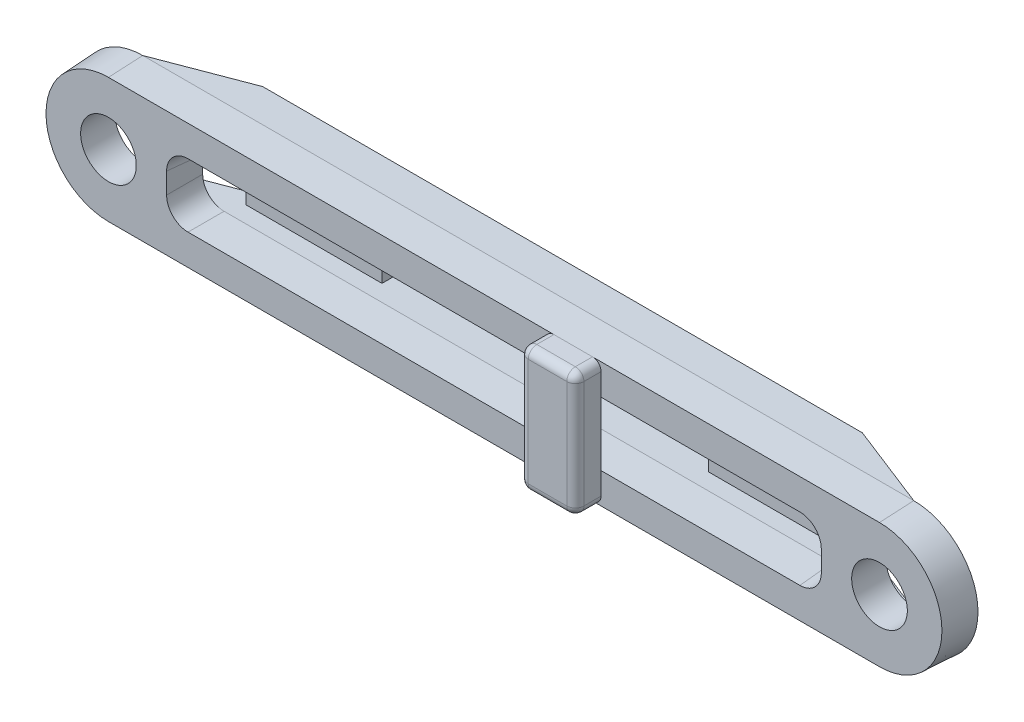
ISO-10303-21;
HEADER;
FILE_DESCRIPTION(('STEP AP214'),'2;1');
FILE_NAME('part.step','',(''),(''),'','','');
FILE_SCHEMA(('AUTOMOTIVE_DESIGN { 1 0 10303 214 1 1 1 1 }'));
ENDSEC;
DATA;
#1=APPLICATION_CONTEXT('core data for automotive mechanical design processes');
#2=APPLICATION_PROTOCOL_DEFINITION('international standard','automotive_design',2000,#1);
#3=PRODUCT_CONTEXT('',#1,'mechanical');
#4=PRODUCT('Part','Part','',(#3));
#5=PRODUCT_RELATED_PRODUCT_CATEGORY('part','',(#4));
#6=PRODUCT_DEFINITION_FORMATION('','',#4);
#7=PRODUCT_DEFINITION_CONTEXT('part definition',#1,'design');
#8=PRODUCT_DEFINITION('design','',#6,#7);
#9=PRODUCT_DEFINITION_SHAPE('','',#8);
#10=(LENGTH_UNIT() NAMED_UNIT(*) SI_UNIT(.MILLI.,.METRE.));
#11=(NAMED_UNIT(*) PLANE_ANGLE_UNIT() SI_UNIT($,.RADIAN.));
#12=(NAMED_UNIT(*) SI_UNIT($,.STERADIAN.) SOLID_ANGLE_UNIT());
#13=UNCERTAINTY_MEASURE_WITH_UNIT(LENGTH_MEASURE(1.E-05),#10,'distance_accuracy_value','');
#14=(GEOMETRIC_REPRESENTATION_CONTEXT(3) GLOBAL_UNCERTAINTY_ASSIGNED_CONTEXT((#13)) GLOBAL_UNIT_ASSIGNED_CONTEXT((#10,
#11,#12)) REPRESENTATION_CONTEXT('',''));
#15=CARTESIAN_POINT('',(0.,0.,0.));
#16=DIRECTION('',(0.,0.,1.));
#17=DIRECTION('',(1.,0.,0.));
#18=AXIS2_PLACEMENT_3D('',#15,#16,#17);
#19=CARTESIAN_POINT('',(2.5,-1.308396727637,-5.625592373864));
#20=DIRECTION('',(1.,0.,0.));
#21=DIRECTION('',(0.,1.,0.));
#22=AXIS2_PLACEMENT_3D('',#19,#20,#21);
#23=PLANE('',#22);
#24=DIRECTION('',(0.,1.,0.));
#25=VECTOR('',#24,1.);
#26=CARTESIAN_POINT('',(2.5,0.,-5.6));
#27=LINE('',#26,#25);
#28=CARTESIAN_POINT('',(2.5,-0.741926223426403,-5.6));
#29=VERTEX_POINT('',#28);
#30=CARTESIAN_POINT('',(2.5,-1.258073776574,-5.6));
#31=VERTEX_POINT('',#30);
#32=EDGE_CURVE('E298',#29,#31,#27,.F.);
#33=ORIENTED_EDGE('',*,*,#32,.F.);
#34=DIRECTION('',(0.,1.,0.));
#35=VECTOR('',#34,1.);
#36=CARTESIAN_POINT('',(2.5,0.,-5.6));
#37=LINE('',#36,#35);
#38=CARTESIAN_POINT('',(2.5,0.741926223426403,-5.6));
#39=VERTEX_POINT('',#38);
#40=EDGE_CURVE('E305',#39,#29,#37,.F.);
#41=ORIENTED_EDGE('',*,*,#40,.F.);
#42=DIRECTION('',(0.,1.,0.));
#43=VECTOR('',#42,1.);
#44=CARTESIAN_POINT('',(2.5,0.,-5.6));
#45=LINE('',#44,#43);
#46=CARTESIAN_POINT('',(2.5,1.2580737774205,-5.6));
#47=VERTEX_POINT('',#46);
#48=EDGE_CURVE('E302',#47,#39,#45,.F.);
#49=ORIENTED_EDGE('',*,*,#48,.F.);
#50=DIRECTION('',(0.,0.,1.));
#51=VECTOR('',#50,1.);
#52=CARTESIAN_POINT('',(2.5,1.258073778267,-5.4));
#53=LINE('',#52,#51);
#54=CARTESIAN_POINT('',(2.5,1.2580737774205,-5.2));
#55=VERTEX_POINT('',#54);
#56=EDGE_CURVE('E299',#55,#47,#53,.F.);
#57=ORIENTED_EDGE('',*,*,#56,.F.);
#58=DIRECTION('',(0.,-1.,0.));
#59=VECTOR('',#58,1.);
#60=CARTESIAN_POINT('',(2.5,1.693500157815E-09,-5.2));
#61=LINE('',#60,#59);
#62=CARTESIAN_POINT('',(2.5,-1.258073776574,-5.2));
#63=VERTEX_POINT('',#62);
#64=EDGE_CURVE('E260',#55,#63,#61,.T.);
#65=ORIENTED_EDGE('',*,*,#64,.T.);
#66=DIRECTION('',(0.,0.,-1.));
#67=VECTOR('',#66,1.);
#68=CARTESIAN_POINT('',(2.5,-1.258073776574,-5.4));
#69=LINE('',#68,#67);
#70=EDGE_CURVE('E263',#31,#63,#69,.F.);
#71=ORIENTED_EDGE('',*,*,#70,.F.);
#72=EDGE_LOOP('',(#33,#41,#49,#57,#65,#71));
#73=FACE_BOUND('',#72,.T.);
#74=ADVANCED_FACE('F16',(#73),#23,.T.);
#75=CARTESIAN_POINT('',(2.3,-1.258073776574,-5.2));
#76=DIRECTION('',(0.,1.,0.));
#77=DIRECTION('',(0.,0.,1.));
#78=AXIS2_PLACEMENT_3D('',#75,#76,#77);
#79=CYLINDRICAL_SURFACE('',#78,0.2);
#80=ORIENTED_EDGE('',*,*,#64,.F.);
#81=CARTESIAN_POINT('',(2.3,1.258073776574,-5.2));
#82=DIRECTION('',(0.,1.,0.));
#83=DIRECTION('',(0.,0.,1.));
#84=AXIS2_PLACEMENT_3D('',#81,#82,#83);
#85=CIRCLE('',#84,0.2);
#86=CARTESIAN_POINT('',(2.3,1.258073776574,-5.));
#87=VERTEX_POINT('',#86);
#88=EDGE_CURVE('E20',#87,#55,#85,.T.);
#89=ORIENTED_EDGE('',*,*,#88,.F.);
#90=DIRECTION('',(0.,1.,0.));
#91=VECTOR('',#90,1.);
#92=CARTESIAN_POINT('',(2.3,0.,-5.));
#93=LINE('',#92,#91);
#94=CARTESIAN_POINT('',(2.3,-1.258073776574,-5.));
#95=VERTEX_POINT('',#94);
#96=EDGE_CURVE('E258',#87,#95,#93,.F.);
#97=ORIENTED_EDGE('',*,*,#96,.T.);
#98=CARTESIAN_POINT('',(2.3,-1.258073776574,-5.2));
#99=DIRECTION('',(0.,1.,0.));
#100=DIRECTION('',(0.,0.,1.));
#101=AXIS2_PLACEMENT_3D('',#98,#99,#100);
#102=CIRCLE('',#101,0.2);
#103=EDGE_CURVE('E289',#63,#95,#102,.F.);
#104=ORIENTED_EDGE('',*,*,#103,.F.);
#105=EDGE_LOOP('',(#80,#89,#97,#104));
#106=FACE_BOUND('',#105,.T.);
#107=ADVANCED_FACE('F255',(#106),#79,.T.);
#108=CARTESIAN_POINT('',(1.374407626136,-1.308396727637,-5.));
#109=DIRECTION('',(0.,0.,1.));
#110=DIRECTION('',(1.,0.,0.));
#111=AXIS2_PLACEMENT_3D('',#108,#109,#110);
#112=PLANE('',#111);
#113=DIRECTION('',(1.,0.,0.));
#114=VECTOR('',#113,1.);
#115=CARTESIAN_POINT('',(1.85,-1.258073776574,-5.));
#116=LINE('',#115,#114);
#117=CARTESIAN_POINT('',(1.4,-1.258073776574,-5.));
#118=VERTEX_POINT('',#117);
#119=EDGE_CURVE('E282',#95,#118,#116,.F.);
#120=ORIENTED_EDGE('',*,*,#119,.F.);
#121=ORIENTED_EDGE('',*,*,#96,.F.);
#122=DIRECTION('',(-1.,0.,0.));
#123=VECTOR('',#122,1.);
#124=CARTESIAN_POINT('',(1.85,1.258073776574,-5.));
#125=LINE('',#124,#123);
#126=CARTESIAN_POINT('',(1.4,1.258073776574,-5.));
#127=VERTEX_POINT('',#126);
#128=EDGE_CURVE('E280',#127,#87,#125,.F.);
#129=ORIENTED_EDGE('',*,*,#128,.F.);
#130=DIRECTION('',(0.,-1.,0.));
#131=VECTOR('',#130,1.);
#132=CARTESIAN_POINT('',(1.4,-1.693500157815E-09,-5.));
#133=LINE('',#132,#131);
#134=EDGE_CURVE('E293',#127,#118,#133,.T.);
#135=ORIENTED_EDGE('',*,*,#134,.T.);
#136=EDGE_LOOP('',(#120,#121,#129,#135));
#137=FACE_BOUND('',#136,.T.);
#138=ADVANCED_FACE('F278',(#137),#112,.T.);
#139=CARTESIAN_POINT('',(1.4,1.258073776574,-5.2));
#140=DIRECTION('',(0.,-1.,0.));
#141=DIRECTION('',(0.,0.,-1.));
#142=AXIS2_PLACEMENT_3D('',#139,#140,#141);
#143=CYLINDRICAL_SURFACE('',#142,0.2);
#144=DIRECTION('',(0.,1.,0.));
#145=VECTOR('',#144,1.);
#146=CARTESIAN_POINT('',(1.2,0.,-5.2));
#147=LINE('',#146,#145);
#148=CARTESIAN_POINT('',(1.2,1.258073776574,-5.2));
#149=VERTEX_POINT('',#148);
#150=CARTESIAN_POINT('',(1.2,-1.2580737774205,-5.2));
#151=VERTEX_POINT('',#150);
#152=EDGE_CURVE('E273',#149,#151,#147,.F.);
#153=ORIENTED_EDGE('',*,*,#152,.T.);
#154=CARTESIAN_POINT('',(1.4,-1.258073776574,-5.2));
#155=DIRECTION('',(0.,-1.,0.));
#156=DIRECTION('',(0.,0.,-1.));
#157=AXIS2_PLACEMENT_3D('',#154,#155,#156);
#158=CIRCLE('',#157,0.2);
#159=EDGE_CURVE('E487',#118,#151,#158,.T.);
#160=ORIENTED_EDGE('',*,*,#159,.F.);
#161=ORIENTED_EDGE('',*,*,#134,.F.);
#162=CARTESIAN_POINT('',(1.4,1.258073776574,-5.2));
#163=DIRECTION('',(0.,-1.,0.));
#164=DIRECTION('',(0.,0.,-1.));
#165=AXIS2_PLACEMENT_3D('',#162,#163,#164);
#166=CIRCLE('',#165,0.2);
#167=EDGE_CURVE('E485',#149,#127,#166,.F.);
#168=ORIENTED_EDGE('',*,*,#167,.F.);
#169=EDGE_LOOP('',(#153,#160,#161,#168));
#170=FACE_BOUND('',#169,.T.);
#171=ADVANCED_FACE('F495',(#170),#143,.T.);
#172=CARTESIAN_POINT('',(2.49836480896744,-1.2325511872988,-5.2));
#173=CARTESIAN_POINT('',(2.51654759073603,-1.37387007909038,-5.2));
#174=CARTESIAN_POINT('',(2.41579630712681,-1.47462136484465,-5.2));
#175=CARTESIAN_POINT('',(2.27447741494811,-1.45643858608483,-5.2));
#176=(BOUNDED_CURVE() B_SPLINE_CURVE(3,(#172,#173,#174,#175),.UNSPECIFIED.,.F.,
.F.) B_SPLINE_CURVE_WITH_KNOTS((4,4),(0.,1.),
.UNSPECIFIED.) CURVE() GEOMETRIC_REPRESENTATION_ITEM() RATIONAL_B_SPLINE_CURVE((1.,
0.740726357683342,0.740726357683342,1.)) REPRESENTATION_ITEM(''));
#177=CARTESIAN_POINT('',(2.3,-1.258073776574,-5.2));
#178=DIRECTION('',(-0.707106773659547,-0.707106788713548,0.));
#179=AXIS1_PLACEMENT('',#177,#178);
#180=SURFACE_OF_REVOLUTION('',#176,#179);
#181=CARTESIAN_POINT('',(2.3,-1.258073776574,-5.2));
#182=DIRECTION('',(0.,0.,-1.));
#183=DIRECTION('',(1.,0.,0.));
#184=AXIS2_PLACEMENT_3D('',#181,#182,#183);
#185=CIRCLE('',#184,0.2);
#186=CARTESIAN_POINT('',(2.3000000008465,-1.458073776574,-5.2));
#187=VERTEX_POINT('',#186);
#188=EDGE_CURVE('E618',#187,#63,#185,.F.);
#189=ORIENTED_EDGE('',*,*,#188,.T.);
#190=ORIENTED_EDGE('',*,*,#103,.T.);
#191=CARTESIAN_POINT('',(2.3,-1.258073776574,-5.2));
#192=DIRECTION('',(1.,0.,0.));
#193=DIRECTION('',(0.,0.,-1.));
#194=AXIS2_PLACEMENT_3D('',#191,#192,#193);
#195=CIRCLE('',#194,0.200000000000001);
#196=EDGE_CURVE('E274',#95,#187,#195,.T.);
#197=ORIENTED_EDGE('',*,*,#196,.T.);
#198=EDGE_LOOP('',(#189,#190,#197));
#199=FACE_BOUND('',#198,.T.);
#200=ADVANCED_FACE('F636',(#199),#180,.T.);
#201=CARTESIAN_POINT('',(2.2744774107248,1.45643858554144,-5.2));
#202=CARTESIAN_POINT('',(2.41579630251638,1.47462136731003,-5.2));
#203=CARTESIAN_POINT('',(2.51654758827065,1.37387008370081,-5.2));
#204=CARTESIAN_POINT('',(2.49836480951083,1.23255119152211,-5.2));
#205=(BOUNDED_CURVE() B_SPLINE_CURVE(3,(#201,#202,#203,#204),.UNSPECIFIED.,.F.,
.F.) B_SPLINE_CURVE_WITH_KNOTS((4,4),(0.,1.),
.UNSPECIFIED.) CURVE() GEOMETRIC_REPRESENTATION_ITEM() RATIONAL_B_SPLINE_CURVE((1.,
0.740726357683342,0.740726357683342,1.)) REPRESENTATION_ITEM(''));
#206=CARTESIAN_POINT('',(2.3,1.258073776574,-5.2));
#207=DIRECTION('',(0.707106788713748,-0.707106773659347,0.));
#208=AXIS1_PLACEMENT('',#206,#207);
#209=SURFACE_OF_REVOLUTION('',#205,#208);
#210=CARTESIAN_POINT('',(2.3,1.258073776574,-5.2));
#211=DIRECTION('',(-1.,0.,0.));
#212=DIRECTION('',(0.,0.,1.));
#213=AXIS2_PLACEMENT_3D('',#210,#211,#212);
#214=CIRCLE('',#213,0.200000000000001);
#215=CARTESIAN_POINT('',(2.299999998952,1.458073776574,-5.2));
#216=VERTEX_POINT('',#215);
#217=EDGE_CURVE('E264',#216,#87,#214,.F.);
#218=ORIENTED_EDGE('',*,*,#217,.T.);
#219=ORIENTED_EDGE('',*,*,#88,.T.);
#220=CARTESIAN_POINT('',(2.3,1.258073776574,-5.2));
#221=DIRECTION('',(0.,0.,-1.));
#222=DIRECTION('',(0.,1.,0.));
#223=AXIS2_PLACEMENT_3D('',#220,#221,#222);
#224=CIRCLE('',#223,0.2);
#225=EDGE_CURVE('E267',#55,#216,#224,.F.);
#226=ORIENTED_EDGE('',*,*,#225,.T.);
#227=EDGE_LOOP('',(#218,#219,#226));
#228=FACE_BOUND('',#227,.T.);
#229=ADVANCED_FACE('F265',(#228),#209,.T.);
#230=CARTESIAN_POINT('',(1.4,-1.258073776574,-5.2));
#231=DIRECTION('',(1.,0.,0.));
#232=DIRECTION('',(0.,0.,-1.));
#233=AXIS2_PLACEMENT_3D('',#230,#231,#232);
#234=CYLINDRICAL_SURFACE('',#233,0.200000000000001);
#235=DIRECTION('',(-1.,0.,0.));
#236=VECTOR('',#235,1.);
#237=CARTESIAN_POINT('',(1.85,-1.458073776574,-5.2));
#238=LINE('',#237,#236);
#239=CARTESIAN_POINT('',(1.4,-1.458073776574,-5.2));
#240=VERTEX_POINT('',#239);
#241=EDGE_CURVE('E481',#240,#187,#238,.F.);
#242=ORIENTED_EDGE('',*,*,#241,.T.);
#243=ORIENTED_EDGE('',*,*,#196,.F.);
#244=ORIENTED_EDGE('',*,*,#119,.T.);
#245=CARTESIAN_POINT('',(1.4,-1.258073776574,-5.2));
#246=DIRECTION('',(1.,0.,0.));
#247=DIRECTION('',(0.,0.,-1.));
#248=AXIS2_PLACEMENT_3D('',#245,#246,#247);
#249=CIRCLE('',#248,0.200000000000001);
#250=EDGE_CURVE('E479',#118,#240,#249,.T.);
#251=ORIENTED_EDGE('',*,*,#250,.T.);
#252=EDGE_LOOP('',(#242,#243,#244,#251));
#253=FACE_BOUND('',#252,.T.);
#254=ADVANCED_FACE('F503',(#253),#234,.T.);
#255=CARTESIAN_POINT('',(2.3,1.258073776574,-5.2));
#256=DIRECTION('',(-1.,0.,0.));
#257=DIRECTION('',(0.,0.,1.));
#258=AXIS2_PLACEMENT_3D('',#255,#256,#257);
#259=CYLINDRICAL_SURFACE('',#258,0.200000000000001);
#260=DIRECTION('',(1.,0.,0.));
#261=VECTOR('',#260,1.);
#262=CARTESIAN_POINT('',(1.85,1.458073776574,-5.2));
#263=LINE('',#262,#261);
#264=CARTESIAN_POINT('',(1.39999986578,1.45807377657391,-5.2));
#265=VERTEX_POINT('',#264);
#266=EDGE_CURVE('E477',#216,#265,#263,.F.);
#267=ORIENTED_EDGE('',*,*,#266,.T.);
#268=CARTESIAN_POINT('',(1.4,1.258073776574,-5.2));
#269=DIRECTION('',(-1.,0.,0.));
#270=DIRECTION('',(0.,0.,1.));
#271=AXIS2_PLACEMENT_3D('',#268,#269,#270);
#272=CIRCLE('',#271,0.200000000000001);
#273=EDGE_CURVE('E287',#265,#127,#272,.F.);
#274=ORIENTED_EDGE('',*,*,#273,.T.);
#275=ORIENTED_EDGE('',*,*,#128,.T.);
#276=ORIENTED_EDGE('',*,*,#217,.F.);
#277=EDGE_LOOP('',(#267,#274,#275,#276));
#278=FACE_BOUND('',#277,.T.);
#279=ADVANCED_FACE('F286',(#278),#259,.T.);
#280=CARTESIAN_POINT('',(1.2,1.308396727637,-5.625592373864));
#281=DIRECTION('',(-1.,0.,0.));
#282=DIRECTION('',(0.,-1.,0.));
#283=AXIS2_PLACEMENT_3D('',#280,#281,#282);
#284=PLANE('',#283);
#285=DIRECTION('',(0.,-1.,0.));
#286=VECTOR('',#285,1.);
#287=CARTESIAN_POINT('',(1.2,0.,-5.6));
#288=LINE('',#287,#286);
#289=CARTESIAN_POINT('',(1.2,0.741926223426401,-5.6));
#290=VERTEX_POINT('',#289);
#291=CARTESIAN_POINT('',(1.2,1.258073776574,-5.6));
#292=VERTEX_POINT('',#291);
#293=EDGE_CURVE('E592',#290,#292,#288,.F.);
#294=ORIENTED_EDGE('',*,*,#293,.F.);
#295=DIRECTION('',(0.,-1.,0.));
#296=VECTOR('',#295,1.);
#297=CARTESIAN_POINT('',(1.2,0.,-5.6));
#298=LINE('',#297,#296);
#299=CARTESIAN_POINT('',(1.2,-0.741926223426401,-5.6));
#300=VERTEX_POINT('',#299);
#301=EDGE_CURVE('E458',#290,#300,#298,.T.);
#302=ORIENTED_EDGE('',*,*,#301,.T.);
#303=DIRECTION('',(0.,-1.,0.));
#304=VECTOR('',#303,1.);
#305=CARTESIAN_POINT('',(1.2,0.,-5.6));
#306=LINE('',#305,#304);
#307=CARTESIAN_POINT('',(1.2,-1.2580737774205,-5.6));
#308=VERTEX_POINT('',#307);
#309=EDGE_CURVE('E599',#308,#300,#306,.F.);
#310=ORIENTED_EDGE('',*,*,#309,.F.);
#311=DIRECTION('',(0.,0.,1.));
#312=VECTOR('',#311,1.);
#313=CARTESIAN_POINT('',(1.2,-1.258073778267,-5.4));
#314=LINE('',#313,#312);
#315=EDGE_CURVE('E604',#151,#308,#314,.F.);
#316=ORIENTED_EDGE('',*,*,#315,.F.);
#317=ORIENTED_EDGE('',*,*,#152,.F.);
#318=DIRECTION('',(0.,0.,-1.));
#319=VECTOR('',#318,1.);
#320=CARTESIAN_POINT('',(1.2,1.258073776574,-5.4));
#321=LINE('',#320,#319);
#322=EDGE_CURVE('E598',#292,#149,#321,.F.);
#323=ORIENTED_EDGE('',*,*,#322,.F.);
#324=EDGE_LOOP('',(#294,#302,#310,#316,#317,#323));
#325=FACE_BOUND('',#324,.T.);
#326=ADVANCED_FACE('F650',(#325),#284,.T.);
#327=CARTESIAN_POINT('',(2.3,-1.258073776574,-5.2));
#328=DIRECTION('',(0.,0.,-1.));
#329=DIRECTION('',(-1.,0.,0.));
#330=AXIS2_PLACEMENT_3D('',#327,#328,#329);
#331=CYLINDRICAL_SURFACE('',#330,0.2);
#332=CARTESIAN_POINT('',(2.3,-1.258073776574,-5.6));
#333=DIRECTION('',(0.,0.,-1.));
#334=DIRECTION('',(-1.,0.,0.));
#335=AXIS2_PLACEMENT_3D('',#332,#333,#334);
#336=CIRCLE('',#335,0.2);
#337=CARTESIAN_POINT('',(2.2999999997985,-1.45807377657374,-5.59999999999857));
#338=VERTEX_POINT('',#337);
#339=EDGE_CURVE('E455',#338,#31,#336,.F.);
#340=ORIENTED_EDGE('',*,*,#339,.T.);
#341=ORIENTED_EDGE('',*,*,#70,.T.);
#342=ORIENTED_EDGE('',*,*,#188,.F.);
#343=DIRECTION('',(0.,0.,1.));
#344=VECTOR('',#343,1.);
#345=CARTESIAN_POINT('',(2.300000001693,-1.458073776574,-5.4));
#346=LINE('',#345,#344);
#347=EDGE_CURVE('E478',#187,#338,#346,.F.);
#348=ORIENTED_EDGE('',*,*,#347,.T.);
#349=EDGE_LOOP('',(#340,#341,#342,#348));
#350=FACE_BOUND('',#349,.T.);
#351=ADVANCED_FACE('F653',(#350),#331,.T.);
#352=CARTESIAN_POINT('',(2.3,1.258073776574,-5.2));
#353=DIRECTION('',(0.,0.,-1.));
#354=DIRECTION('',(-1.,0.,0.));
#355=AXIS2_PLACEMENT_3D('',#352,#353,#354);
#356=CYLINDRICAL_SURFACE('',#355,0.2);
#357=CARTESIAN_POINT('',(2.3,1.258073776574,-5.6));
#358=DIRECTION('',(0.,0.,-1.));
#359=DIRECTION('',(-1.,0.,0.));
#360=AXIS2_PLACEMENT_3D('',#357,#358,#359);
#361=CIRCLE('',#360,0.2);
#362=CARTESIAN_POINT('',(2.299999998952,1.4580737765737,-5.60000000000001));
#363=VERTEX_POINT('',#362);
#364=EDGE_CURVE('E448',#47,#363,#361,.F.);
#365=ORIENTED_EDGE('',*,*,#364,.T.);
#366=DIRECTION('',(0.,0.,-1.));
#367=VECTOR('',#366,1.);
#368=CARTESIAN_POINT('',(2.299999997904,1.458073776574,-5.4));
#369=LINE('',#368,#367);
#370=EDGE_CURVE('E551',#363,#216,#369,.F.);
#371=ORIENTED_EDGE('',*,*,#370,.T.);
#372=ORIENTED_EDGE('',*,*,#225,.F.);
#373=ORIENTED_EDGE('',*,*,#56,.T.);
#374=EDGE_LOOP('',(#365,#371,#372,#373));
#375=FACE_BOUND('',#374,.T.);
#376=ADVANCED_FACE('F585',(#375),#356,.T.);
#377=CARTESIAN_POINT('',(1.4255225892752,-1.45643858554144,-5.2));
#378=CARTESIAN_POINT('',(1.28420369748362,-1.47462136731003,-5.2));
#379=CARTESIAN_POINT('',(1.18345241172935,-1.37387008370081,-5.2));
#380=CARTESIAN_POINT('',(1.20163519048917,-1.23255119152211,-5.2));
#381=(BOUNDED_CURVE() B_SPLINE_CURVE(3,(#377,#378,#379,#380),.UNSPECIFIED.,.F.,
.F.) B_SPLINE_CURVE_WITH_KNOTS((4,4),(0.,1.),
.UNSPECIFIED.) CURVE() GEOMETRIC_REPRESENTATION_ITEM() RATIONAL_B_SPLINE_CURVE((1.,
0.740726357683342,0.740726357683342,1.)) REPRESENTATION_ITEM(''));
#382=CARTESIAN_POINT('',(1.4,-1.258073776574,-5.2));
#383=DIRECTION('',(-0.707106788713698,0.707106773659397,0.));
#384=AXIS1_PLACEMENT('',#382,#383);
#385=SURFACE_OF_REVOLUTION('',#381,#384);
#386=CARTESIAN_POINT('',(1.4,-1.258073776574,-5.2));
#387=DIRECTION('',(0.,0.,-1.));
#388=DIRECTION('',(0.,-1.,0.));
#389=AXIS2_PLACEMENT_3D('',#386,#387,#388);
#390=CIRCLE('',#389,0.2);
#391=EDGE_CURVE('E499',#151,#240,#390,.F.);
#392=ORIENTED_EDGE('',*,*,#391,.T.);
#393=ORIENTED_EDGE('',*,*,#250,.F.);
#394=ORIENTED_EDGE('',*,*,#159,.T.);
#395=EDGE_LOOP('',(#392,#393,#394));
#396=FACE_BOUND('',#395,.T.);
#397=ADVANCED_FACE('F497',(#396),#385,.T.);
#398=CARTESIAN_POINT('',(1.374407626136,-1.458073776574,-5.625592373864));
#399=DIRECTION('',(0.,-1.,0.));
#400=DIRECTION('',(1.,0.,0.));
#401=AXIS2_PLACEMENT_3D('',#398,#399,#400);
#402=PLANE('',#401);
#403=DIRECTION('',(-1.,0.,0.));
#404=VECTOR('',#403,1.);
#405=CARTESIAN_POINT('',(0.,-1.45807377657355,-5.59999999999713));
#406=LINE('',#405,#404);
#407=CARTESIAN_POINT('',(1.3999998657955,-1.45807377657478,-5.59999999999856));
#408=VERTEX_POINT('',#407);
#409=EDGE_CURVE('E849',#408,#338,#406,.F.);
#410=ORIENTED_EDGE('',*,*,#409,.T.);
#411=ORIENTED_EDGE('',*,*,#347,.F.);
#412=ORIENTED_EDGE('',*,*,#241,.F.);
#413=DIRECTION('',(0.,0.,-1.));
#414=VECTOR('',#413,1.);
#415=CARTESIAN_POINT('',(1.4,-1.458073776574,-5.4));
#416=LINE('',#415,#414);
#417=EDGE_CURVE('E506',#240,#408,#416,.T.);
#418=ORIENTED_EDGE('',*,*,#417,.T.);
#419=EDGE_LOOP('',(#410,#411,#412,#418));
#420=FACE_BOUND('',#419,.T.);
#421=ADVANCED_FACE('F578',(#420),#402,.T.);
#422=CARTESIAN_POINT('',(1.20163519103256,1.2325511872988,-5.2));
#423=CARTESIAN_POINT('',(1.18345240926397,1.37387007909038,-5.2));
#424=CARTESIAN_POINT('',(1.28420369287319,1.47462136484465,-5.2));
#425=CARTESIAN_POINT('',(1.42552258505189,1.45643858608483,-5.2));
#426=(BOUNDED_CURVE() B_SPLINE_CURVE(3,(#422,#423,#424,#425),.UNSPECIFIED.,.F.,
.F.) B_SPLINE_CURVE_WITH_KNOTS((4,4),(0.,1.),
.UNSPECIFIED.) CURVE() GEOMETRIC_REPRESENTATION_ITEM() RATIONAL_B_SPLINE_CURVE((1.,
0.740726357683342,0.740726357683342,1.)) REPRESENTATION_ITEM(''));
#427=CARTESIAN_POINT('',(1.4,1.258073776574,-5.2));
#428=DIRECTION('',(0.707106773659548,0.707106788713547,0.));
#429=AXIS1_PLACEMENT('',#427,#428);
#430=SURFACE_OF_REVOLUTION('',#426,#429);
#431=CARTESIAN_POINT('',(1.4,1.258073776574,-5.2));
#432=DIRECTION('',(0.,0.,-1.));
#433=DIRECTION('',(-1.,0.,0.));
#434=AXIS2_PLACEMENT_3D('',#431,#432,#433);
#435=CIRCLE('',#434,0.2);
#436=EDGE_CURVE('E558',#265,#149,#435,.F.);
#437=ORIENTED_EDGE('',*,*,#436,.T.);
#438=ORIENTED_EDGE('',*,*,#167,.T.);
#439=ORIENTED_EDGE('',*,*,#273,.F.);
#440=EDGE_LOOP('',(#437,#438,#439));
#441=FACE_BOUND('',#440,.T.);
#442=ADVANCED_FACE('F573',(#441),#430,.T.);
#443=CARTESIAN_POINT('',(2.325592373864,1.458073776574,-5.625592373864));
#444=DIRECTION('',(0.,1.,0.));
#445=DIRECTION('',(-1.,0.,0.));
#446=AXIS2_PLACEMENT_3D('',#443,#444,#445);
#447=PLANE('',#446);
#448=DIRECTION('',(1.,0.,0.));
#449=VECTOR('',#448,1.);
#450=CARTESIAN_POINT('',(0.,1.4580737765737,-5.60000000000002));
#451=LINE('',#450,#449);
#452=CARTESIAN_POINT('',(1.39999986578,1.45807377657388,-5.60000000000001));
#453=VERTEX_POINT('',#452);
#454=EDGE_CURVE('E846',#363,#453,#451,.F.);
#455=ORIENTED_EDGE('',*,*,#454,.T.);
#456=DIRECTION('',(0.,0.,1.));
#457=VECTOR('',#456,1.);
#458=CARTESIAN_POINT('',(1.39999973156,1.45807377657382,-5.4));
#459=LINE('',#458,#457);
#460=EDGE_CURVE('E561',#453,#265,#459,.T.);
#461=ORIENTED_EDGE('',*,*,#460,.T.);
#462=ORIENTED_EDGE('',*,*,#266,.F.);
#463=ORIENTED_EDGE('',*,*,#370,.F.);
#464=EDGE_LOOP('',(#455,#461,#462,#463));
#465=FACE_BOUND('',#464,.T.);
#466=ADVANCED_FACE('F577',(#465),#447,.T.);
#467=CARTESIAN_POINT('',(7.643265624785,0.2682038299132,-5.574442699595));
#468=DIRECTION('',(0.998629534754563,0.,-0.0523359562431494));
#469=DIRECTION('',(0.,-1.,0.));
#470=AXIS2_PLACEMENT_3D('',#467,#468,#469);
#471=PLANE('',#470);
#472=DIRECTION('',(0.0522644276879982,0.0522644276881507,0.997264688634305));
#473=VECTOR('',#472,1.);
#474=CARTESIAN_POINT('',(7.62124581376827,0.221931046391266,-5.99460572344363));
#475=LINE('',#474,#473);
#476=CARTESIAN_POINT('',(7.64192622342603,0.242611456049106,-5.6));
#477=VERTEX_POINT('',#476);
#478=CARTESIAN_POINT('',(7.60000000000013,0.200685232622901,-6.4));
#479=VERTEX_POINT('',#478);
#480=EDGE_CURVE('E442',#477,#479,#475,.F.);
#481=ORIENTED_EDGE('',*,*,#480,.T.);
#482=DIRECTION('',(0.,-1.,0.));
#483=VECTOR('',#482,1.);
#484=CARTESIAN_POINT('',(7.6,0.,-6.4));
#485=LINE('',#484,#483);
#486=CARTESIAN_POINT('',(7.60000000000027,-0.200685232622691,-6.4));
#487=VERTEX_POINT('',#486);
#488=EDGE_CURVE('E422',#479,#487,#485,.T.);
#489=ORIENTED_EDGE('',*,*,#488,.T.);
#490=DIRECTION('',(-0.0522644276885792,0.0522644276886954,-0.997264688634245));
#491=VECTOR('',#490,1.);
#492=CARTESIAN_POINT('',(7.6212458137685,-0.22193104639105,-5.994605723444));
#493=LINE('',#492,#491);
#494=CARTESIAN_POINT('',(7.64192622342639,-0.24261145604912,-5.60000000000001));
#495=VERTEX_POINT('',#494);
#496=EDGE_CURVE('E475',#487,#495,#493,.F.);
#497=ORIENTED_EDGE('',*,*,#496,.T.);
#498=DIRECTION('',(0.,-1.,0.));
#499=VECTOR('',#498,1.);
#500=CARTESIAN_POINT('',(7.641926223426,0.,-5.6));
#501=LINE('',#500,#499);
#502=EDGE_CURVE('E451',#495,#477,#501,.F.);
#503=ORIENTED_EDGE('',*,*,#502,.T.);
#504=EDGE_LOOP('',(#481,#489,#497,#503));
#505=FACE_BOUND('',#504,.T.);
#506=ADVANCED_FACE('F659',(#505),#471,.F.);
#507=CARTESIAN_POINT('',(7.14340232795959,-0.243402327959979,-5.55874128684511));
#508=DIRECTION('',(-0.0522644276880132,0.0522644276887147,-0.997264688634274));
#509=DIRECTION('',(0.,0.998629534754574,0.0523359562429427));
#510=AXIS2_PLACEMENT_3D('',#507,#508,#509);
#511=CYLINDRICAL_SURFACE('',#510,0.500000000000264);
#512=CARTESIAN_POINT('',(7.14124005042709,-0.241240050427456,-5.6));
#513=DIRECTION('',(0.,0.,1.));
#514=DIRECTION('',(-0.707106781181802,0.707106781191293,0.));
#515=AXIS2_PLACEMENT_3D('',#512,#513,#514);
#516=ELLIPSE('',#515,0.501371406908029,0.500000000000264);
#517=CARTESIAN_POINT('',(7.14261145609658,-0.74192622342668,-5.6));
#518=VERTEX_POINT('',#517);
#519=EDGE_CURVE('E452',#518,#495,#516,.T.);
#520=ORIENTED_EDGE('',*,*,#519,.T.);
#521=ORIENTED_EDGE('',*,*,#496,.F.);
#522=CARTESIAN_POINT('',(7.09931382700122,-0.199313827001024,-6.4));
#523=DIRECTION('',(0.,0.,1.));
#524=DIRECTION('',(-0.707106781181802,0.707106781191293,0.));
#525=AXIS2_PLACEMENT_3D('',#522,#523,#524);
#526=ELLIPSE('',#525,0.501371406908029,0.500000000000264);
#527=CARTESIAN_POINT('',(7.10068523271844,-0.70000000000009,-6.3999999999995));
#528=VERTEX_POINT('',#527);
#529=EDGE_CURVE('E419',#487,#528,#526,.F.);
#530=ORIENTED_EDGE('',*,*,#529,.T.);
#531=DIRECTION('',(-0.0522644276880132,0.0522644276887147,-0.997264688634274));
#532=VECTOR('',#531,1.);
#533=CARTESIAN_POINT('',(7.14340232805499,-0.742717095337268,-5.58490926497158));
#534=LINE('',#533,#532);
#535=EDGE_CURVE('E429',#528,#518,#534,.F.);
#536=ORIENTED_EDGE('',*,*,#535,.T.);
#537=EDGE_LOOP('',(#520,#521,#530,#536));
#538=FACE_BOUND('',#537,.T.);
#539=ADVANCED_FACE('F580',(#538),#511,.F.);
#540=CARTESIAN_POINT('',(9.,0.,-6.39999999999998));
#541=DIRECTION('',(0.,0.,-1.));
#542=DIRECTION('',(0.,1.,0.));
#543=AXIS2_PLACEMENT_3D('',#540,#541,#542);
#544=CONICAL_SURFACE('',#543,1.5000000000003,0.0523598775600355);
#545=DIRECTION('',(0.,0.0523359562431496,0.998629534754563));
#546=VECTOR('',#545,1.);
#547=CARTESIAN_POINT('',(9.,-1.479036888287,-6.));
#548=LINE('',#547,#546);
#549=CARTESIAN_POINT('',(9.,-1.4580737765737,-5.60000000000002));
#550=VERTEX_POINT('',#549);
#551=CARTESIAN_POINT('',(9.,-1.50000000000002,-6.4));
#552=VERTEX_POINT('',#551);
#553=EDGE_CURVE('E853',#550,#552,#548,.F.);
#554=ORIENTED_EDGE('',*,*,#553,.T.);
#555=CARTESIAN_POINT('',(9.,0.,-6.39999999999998));
#556=DIRECTION('',(0.,0.,-1.));
#557=DIRECTION('',(0.,1.,0.));
#558=AXIS2_PLACEMENT_3D('',#555,#556,#557);
#559=CIRCLE('',#558,1.5000000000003);
#560=CARTESIAN_POINT('',(9.,1.50000000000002,-6.4));
#561=VERTEX_POINT('',#560);
#562=EDGE_CURVE('E415',#552,#561,#559,.F.);
#563=ORIENTED_EDGE('',*,*,#562,.T.);
#564=DIRECTION('',(0.,0.0523359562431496,-0.998629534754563));
#565=VECTOR('',#564,1.);
#566=CARTESIAN_POINT('',(9.,1.479036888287,-6.));
#567=LINE('',#566,#565);
#568=CARTESIAN_POINT('',(9.,1.4580737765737,-5.60000000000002));
#569=VERTEX_POINT('',#568);
#570=EDGE_CURVE('E867',#561,#569,#567,.F.);
#571=ORIENTED_EDGE('',*,*,#570,.T.);
#572=CARTESIAN_POINT('',(9.,0.,-5.60000000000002));
#573=DIRECTION('',(0.,0.,-1.));
#574=DIRECTION('',(0.,1.,0.));
#575=AXIS2_PLACEMENT_3D('',#572,#573,#574);
#576=CIRCLE('',#575,1.4580737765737);
#577=EDGE_CURVE('E446',#569,#550,#576,.T.);
#578=ORIENTED_EDGE('',*,*,#577,.T.);
#579=EDGE_LOOP('',(#554,#563,#571,#578));
#580=FACE_BOUND('',#579,.T.);
#581=ADVANCED_FACE('F897',(#580),#544,.T.);
#582=CARTESIAN_POINT('',(9.,0.,-5.6));
#583=DIRECTION('',(0.,0.,-1.));
#584=DIRECTION('',(-1.,0.,0.));
#585=AXIS2_PLACEMENT_3D('',#582,#583,#584);
#586=CYLINDRICAL_SURFACE('',#585,0.65);
#587=CARTESIAN_POINT('',(9.,0.,-5.6));
#588=DIRECTION('',(0.,0.,-1.));
#589=DIRECTION('',(-1.,0.,0.));
#590=AXIS2_PLACEMENT_3D('',#587,#588,#589);
#591=CIRCLE('',#590,0.65);
#592=CARTESIAN_POINT('',(8.35,0.,-5.6));
#593=VERTEX_POINT('',#592);
#594=EDGE_CURVE('E443',#593,#593,#591,.F.);
#595=ORIENTED_EDGE('',*,*,#594,.T.);
#596=EDGE_LOOP('',(#595));
#597=FACE_BOUND('',#596,.T.);
#598=CARTESIAN_POINT('',(9.,0.,-6.4));
#599=DIRECTION('',(0.,0.,-1.));
#600=DIRECTION('',(-1.,0.,0.));
#601=AXIS2_PLACEMENT_3D('',#598,#599,#600);
#602=CIRCLE('',#601,0.65);
#603=CARTESIAN_POINT('',(8.35,0.,-6.4));
#604=VERTEX_POINT('',#603);
#605=EDGE_CURVE('E412',#604,#604,#602,.T.);
#606=ORIENTED_EDGE('',*,*,#605,.T.);
#607=EDGE_LOOP('',(#606));
#608=FACE_BOUND('',#607,.T.);
#609=ADVANCED_FACE('F668',(#597,#608),#586,.F.);
#610=CARTESIAN_POINT('',(9.36,-1.500893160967,-6.374423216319));
#611=DIRECTION('',(0.,-0.999390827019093,-0.0348994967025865));
#612=DIRECTION('',(-1.,0.,0.));
#613=AXIS2_PLACEMENT_3D('',#610,#611,#612);
#614=PLANE('',#613);
#615=DIRECTION('',(-1.,0.,0.));
#616=VECTOR('',#615,1.);
#617=CARTESIAN_POINT('',(0.,-1.472063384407,-7.2));
#618=LINE('',#617,#616);
#619=CARTESIAN_POINT('',(-7.,-1.47206338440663,-7.19999999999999));
#620=VERTEX_POINT('',#619);
#621=CARTESIAN_POINT('',(7.,-1.47206338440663,-7.19999999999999));
#622=VERTEX_POINT('',#621);
#623=EDGE_CURVE('E540',#620,#622,#618,.F.);
#624=ORIENTED_EDGE('',*,*,#623,.T.);
#625=DIRECTION('',(0.928398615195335,-0.0129681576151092,0.371359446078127));
#626=VECTOR('',#625,1.);
#627=CARTESIAN_POINT('',(7.,-1.47206338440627,-7.19999999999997));
#628=LINE('',#627,#626);
#629=EDGE_CURVE('E433',#622,#552,#628,.T.);
#630=ORIENTED_EDGE('',*,*,#629,.T.);
#631=DIRECTION('',(1.,0.,0.));
#632=VECTOR('',#631,1.);
#633=CARTESIAN_POINT('',(0.,-1.5000000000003,-6.39999999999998));
#634=LINE('',#633,#632);
#635=CARTESIAN_POINT('',(-9.00000000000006,-1.50000000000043,-6.39999999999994));
#636=VERTEX_POINT('',#635);
#637=EDGE_CURVE('E513',#552,#636,#634,.F.);
#638=ORIENTED_EDGE('',*,*,#637,.T.);
#639=DIRECTION('',(0.928398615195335,0.0129681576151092,-0.371359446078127));
#640=VECTOR('',#639,1.);
#641=CARTESIAN_POINT('',(-9.,-1.49999999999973,-6.39999999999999));
#642=LINE('',#641,#640);
#643=EDGE_CURVE('E436',#636,#620,#642,.T.);
#644=ORIENTED_EDGE('',*,*,#643,.T.);
#645=EDGE_LOOP('',(#624,#630,#638,#644));
#646=FACE_BOUND('',#645,.T.);
#647=ADVANCED_FACE('F664',(#646),#614,.T.);
#648=CARTESIAN_POINT('',(6.986924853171,-0.7570540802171,-6.774423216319));
#649=DIRECTION('',(-0.999390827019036,0.,0.0348994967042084));
#650=DIRECTION('',(0.,1.,0.));
#651=AXIS2_PLACEMENT_3D('',#648,#649,#650);
#652=PLANE('',#651);
#653=DIRECTION('',(-0.0348782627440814,0.0348782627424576,-0.998782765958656));
#654=VECTOR('',#653,1.);
#655=CARTESIAN_POINT('',(6.98603169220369,0.713968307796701,-6.80000000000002));
#656=LINE('',#655,#654);
#657=CARTESIAN_POINT('',(6.98603169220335,0.7139683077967,-6.8));
#658=VERTEX_POINT('',#657);
#659=CARTESIAN_POINT('',(6.97206338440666,0.727936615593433,-7.2));
#660=VERTEX_POINT('',#659);
#661=EDGE_CURVE('E471',#658,#660,#656,.T.);
#662=ORIENTED_EDGE('',*,*,#661,.F.);
#663=DIRECTION('',(0.,1.,0.));
#664=VECTOR('',#663,1.);
#665=CARTESIAN_POINT('',(6.986031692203,0.,-6.8));
#666=LINE('',#665,#664);
#667=CARTESIAN_POINT('',(6.98603169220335,-0.7139683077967,-6.8));
#668=VERTEX_POINT('',#667);
#669=EDGE_CURVE('E330',#658,#668,#666,.F.);
#670=ORIENTED_EDGE('',*,*,#669,.T.);
#671=DIRECTION('',(0.0348782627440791,0.0348782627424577,0.998782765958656));
#672=VECTOR('',#671,1.);
#673=CARTESIAN_POINT('',(6.97206338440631,-0.727936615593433,-7.19999999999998));
#674=LINE('',#673,#672);
#675=CARTESIAN_POINT('',(6.97206338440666,-0.727936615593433,-7.2));
#676=VERTEX_POINT('',#675);
#677=EDGE_CURVE('E473',#676,#668,#674,.T.);
#678=ORIENTED_EDGE('',*,*,#677,.F.);
#679=DIRECTION('',(0.,-1.,0.));
#680=VECTOR('',#679,1.);
#681=CARTESIAN_POINT('',(6.972063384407,0.,-7.2));
#682=LINE('',#681,#680);
#683=EDGE_CURVE('E549',#676,#660,#682,.F.);
#684=ORIENTED_EDGE('',*,*,#683,.T.);
#685=EDGE_LOOP('',(#662,#670,#678,#684));
#686=FACE_BOUND('',#685,.T.);
#687=ADVANCED_FACE('F667',(#686),#652,.F.);
#688=CARTESIAN_POINT('',(3.813075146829,0.7570540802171,-6.774423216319));
#689=DIRECTION('',(0.999390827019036,0.,0.0348994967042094));
#690=DIRECTION('',(0.,-1.,0.));
#691=AXIS2_PLACEMENT_3D('',#688,#689,#690);
#692=PLANE('',#691);
#693=DIRECTION('',(-0.0348782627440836,-0.0348782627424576,0.998782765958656));
#694=VECTOR('',#693,1.);
#695=CARTESIAN_POINT('',(3.82793661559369,0.727936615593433,-7.19999999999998));
#696=LINE('',#695,#694);
#697=CARTESIAN_POINT('',(3.82793661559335,0.727936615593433,-7.2));
#698=VERTEX_POINT('',#697);
#699=CARTESIAN_POINT('',(3.81396830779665,0.7139683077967,-6.8));
#700=VERTEX_POINT('',#699);
#701=EDGE_CURVE('E467',#698,#700,#696,.T.);
#702=ORIENTED_EDGE('',*,*,#701,.F.);
#703=DIRECTION('',(0.,1.,0.));
#704=VECTOR('',#703,1.);
#705=CARTESIAN_POINT('',(3.827936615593,0.,-7.2));
#706=LINE('',#705,#704);
#707=CARTESIAN_POINT('',(3.82793661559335,-0.727936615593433,-7.2));
#708=VERTEX_POINT('',#707);
#709=EDGE_CURVE('E316',#698,#708,#706,.F.);
#710=ORIENTED_EDGE('',*,*,#709,.T.);
#711=DIRECTION('',(0.0348782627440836,-0.0348782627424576,-0.998782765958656));
#712=VECTOR('',#711,1.);
#713=CARTESIAN_POINT('',(3.81396830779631,-0.713968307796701,-6.80000000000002));
#714=LINE('',#713,#712);
#715=CARTESIAN_POINT('',(3.81396830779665,-0.7139683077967,-6.8));
#716=VERTEX_POINT('',#715);
#717=EDGE_CURVE('E469',#716,#708,#714,.T.);
#718=ORIENTED_EDGE('',*,*,#717,.F.);
#719=DIRECTION('',(0.,-1.,0.));
#720=VECTOR('',#719,1.);
#721=CARTESIAN_POINT('',(3.813968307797,0.,-6.8));
#722=LINE('',#721,#720);
#723=EDGE_CURVE('E326',#716,#700,#722,.F.);
#724=ORIENTED_EDGE('',*,*,#723,.T.);
#725=EDGE_LOOP('',(#702,#710,#718,#724));
#726=FACE_BOUND('',#725,.T.);
#727=ADVANCED_FACE('F672',(#726),#692,.F.);
#728=CARTESIAN_POINT('',(-6.986924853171,-0.7570540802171,-6.774423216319));
#729=DIRECTION('',(-0.999390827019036,0.,-0.0348994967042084));
#730=DIRECTION('',(0.,1.,0.));
#731=AXIS2_PLACEMENT_3D('',#728,#729,#730);
#732=PLANE('',#731);
#733=DIRECTION('',(0.,1.,0.));
#734=VECTOR('',#733,1.);
#735=CARTESIAN_POINT('',(-6.986031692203,0.,-6.8));
#736=LINE('',#735,#734);
#737=CARTESIAN_POINT('',(-6.98603169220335,-0.7139683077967,-6.8));
#738=VERTEX_POINT('',#737);
#739=CARTESIAN_POINT('',(-6.98603169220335,0.7139683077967,-6.8));
#740=VERTEX_POINT('',#739);
#741=EDGE_CURVE('E319',#738,#740,#736,.T.);
#742=ORIENTED_EDGE('',*,*,#741,.T.);
#743=DIRECTION('',(-0.0348782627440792,-0.0348782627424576,0.998782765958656));
#744=VECTOR('',#743,1.);
#745=CARTESIAN_POINT('',(-6.97206338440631,0.727936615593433,-7.19999999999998));
#746=LINE('',#745,#744);
#747=CARTESIAN_POINT('',(-6.97206338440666,0.727936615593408,-7.2));
#748=VERTEX_POINT('',#747);
#749=EDGE_CURVE('E465',#748,#740,#746,.T.);
#750=ORIENTED_EDGE('',*,*,#749,.F.);
#751=DIRECTION('',(0.,1.,0.));
#752=VECTOR('',#751,1.);
#753=CARTESIAN_POINT('',(-6.972063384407,0.,-7.2));
#754=LINE('',#753,#752);
#755=CARTESIAN_POINT('',(-6.97206338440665,-0.727936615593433,-7.2));
#756=VERTEX_POINT('',#755);
#757=EDGE_CURVE('E535',#748,#756,#754,.F.);
#758=ORIENTED_EDGE('',*,*,#757,.T.);
#759=DIRECTION('',(0.0348782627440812,-0.0348782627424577,-0.998782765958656));
#760=VECTOR('',#759,1.);
#761=CARTESIAN_POINT('',(-6.98603169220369,-0.713968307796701,-6.80000000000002));
#762=LINE('',#761,#760);
#763=EDGE_CURVE('E463',#738,#756,#762,.T.);
#764=ORIENTED_EDGE('',*,*,#763,.F.);
#765=EDGE_LOOP('',(#742,#750,#758,#764));
#766=FACE_BOUND('',#765,.T.);
#767=ADVANCED_FACE('F676',(#766),#732,.T.);
#768=CARTESIAN_POINT('',(-3.813075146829,0.7570540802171,-6.774423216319));
#769=DIRECTION('',(0.999390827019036,0.,-0.0348994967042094));
#770=DIRECTION('',(0.,-1.,0.));
#771=AXIS2_PLACEMENT_3D('',#768,#769,#770);
#772=PLANE('',#771);
#773=DIRECTION('',(0.,-1.,0.));
#774=VECTOR('',#773,1.);
#775=CARTESIAN_POINT('',(-3.813968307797,0.,-6.8));
#776=LINE('',#775,#774);
#777=CARTESIAN_POINT('',(-3.81396830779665,0.7139683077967,-6.8));
#778=VERTEX_POINT('',#777);
#779=CARTESIAN_POINT('',(-3.81396830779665,-0.7139683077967,-6.8));
#780=VERTEX_POINT('',#779);
#781=EDGE_CURVE('E342',#778,#780,#776,.T.);
#782=ORIENTED_EDGE('',*,*,#781,.T.);
#783=DIRECTION('',(0.0348782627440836,0.0348782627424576,0.998782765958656));
#784=VECTOR('',#783,1.);
#785=CARTESIAN_POINT('',(-3.82793661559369,-0.727936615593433,-7.19999999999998));
#786=LINE('',#785,#784);
#787=CARTESIAN_POINT('',(-3.82793661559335,-0.727936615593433,-7.2));
#788=VERTEX_POINT('',#787);
#789=EDGE_CURVE('E461',#788,#780,#786,.T.);
#790=ORIENTED_EDGE('',*,*,#789,.F.);
#791=DIRECTION('',(0.,-1.,0.));
#792=VECTOR('',#791,1.);
#793=CARTESIAN_POINT('',(-3.827936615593,0.,-7.2));
#794=LINE('',#793,#792);
#795=CARTESIAN_POINT('',(-3.82793661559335,0.727936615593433,-7.2));
#796=VERTEX_POINT('',#795);
#797=EDGE_CURVE('E320',#788,#796,#794,.F.);
#798=ORIENTED_EDGE('',*,*,#797,.T.);
#799=DIRECTION('',(-0.0348782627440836,0.0348782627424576,-0.998782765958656));
#800=VECTOR('',#799,1.);
#801=CARTESIAN_POINT('',(-3.81396830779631,0.713968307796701,-6.80000000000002));
#802=LINE('',#801,#800);
#803=EDGE_CURVE('E459',#778,#796,#802,.T.);
#804=ORIENTED_EDGE('',*,*,#803,.F.);
#805=EDGE_LOOP('',(#782,#790,#798,#804));
#806=FACE_BOUND('',#805,.T.);
#807=ADVANCED_FACE('F680',(#806),#772,.T.);
#808=CARTESIAN_POINT('',(-9.36,1.500893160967,-6.374423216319));
#809=DIRECTION('',(0.,0.999390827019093,-0.0348994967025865));
#810=DIRECTION('',(1.,0.,0.));
#811=AXIS2_PLACEMENT_3D('',#808,#809,#810);
#812=PLANE('',#811);
#813=DIRECTION('',(1.,0.,0.));
#814=VECTOR('',#813,1.);
#815=CARTESIAN_POINT('',(0.,1.472063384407,-7.2));
#816=LINE('',#815,#814);
#817=CARTESIAN_POINT('',(7.,1.47206338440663,-7.2));
#818=VERTEX_POINT('',#817);
#819=CARTESIAN_POINT('',(-7.,1.47206338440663,-7.19999999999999));
#820=VERTEX_POINT('',#819);
#821=EDGE_CURVE('E329',#818,#820,#816,.F.);
#822=ORIENTED_EDGE('',*,*,#821,.T.);
#823=DIRECTION('',(-0.928398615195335,0.0129681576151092,0.371359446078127));
#824=VECTOR('',#823,1.);
#825=CARTESIAN_POINT('',(-7.,1.47206338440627,-7.19999999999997));
#826=LINE('',#825,#824);
#827=CARTESIAN_POINT('',(-9.00000000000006,1.50000000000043,-6.39999999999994));
#828=VERTEX_POINT('',#827);
#829=EDGE_CURVE('E344',#820,#828,#826,.T.);
#830=ORIENTED_EDGE('',*,*,#829,.T.);
#831=DIRECTION('',(-1.,0.,0.));
#832=VECTOR('',#831,1.);
#833=CARTESIAN_POINT('',(0.,1.5000000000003,-6.39999999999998));
#834=LINE('',#833,#832);
#835=EDGE_CURVE('E567',#828,#561,#834,.F.);
#836=ORIENTED_EDGE('',*,*,#835,.T.);
#837=DIRECTION('',(-0.928398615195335,-0.0129681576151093,-0.371359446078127));
#838=VECTOR('',#837,1.);
#839=CARTESIAN_POINT('',(9.,1.49999999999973,-6.39999999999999));
#840=LINE('',#839,#838);
#841=EDGE_CURVE('E408',#561,#818,#840,.T.);
#842=ORIENTED_EDGE('',*,*,#841,.T.);
#843=EDGE_LOOP('',(#822,#830,#836,#842));
#844=FACE_BOUND('',#843,.T.);
#845=ADVANCED_FACE('F684',(#844),#812,.T.);
#846=CARTESIAN_POINT('',(1.174,-0.7716032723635,-5.6));
#847=DIRECTION('',(0.,0.,1.));
#848=DIRECTION('',(1.,0.,0.));
#849=AXIS2_PLACEMENT_3D('',#846,#847,#848);
#850=PLANE('',#849);
#851=DIRECTION('',(1.,0.,0.));
#852=VECTOR('',#851,1.);
#853=CARTESIAN_POINT('',(0.,0.741926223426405,-5.6));
#854=LINE('',#853,#852);
#855=EDGE_CURVE('E524',#290,#39,#854,.T.);
#856=ORIENTED_EDGE('',*,*,#855,.T.);
#857=ORIENTED_EDGE('',*,*,#40,.T.);
#858=DIRECTION('',(-1.,0.,0.));
#859=VECTOR('',#858,1.);
#860=CARTESIAN_POINT('',(0.,-0.741926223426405,-5.6));
#861=LINE('',#860,#859);
#862=EDGE_CURVE('E428',#29,#300,#861,.T.);
#863=ORIENTED_EDGE('',*,*,#862,.T.);
#864=ORIENTED_EDGE('',*,*,#301,.F.);
#865=EDGE_LOOP('',(#856,#857,#863,#864));
#866=FACE_BOUND('',#865,.T.);
#867=ADVANCED_FACE('F688',(#866),#850,.F.);
#868=CARTESIAN_POINT('',(10.87639672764,1.516396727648,-5.6));
#869=DIRECTION('',(0.,0.,1.));
#870=DIRECTION('',(-1.,0.,0.));
#871=AXIS2_PLACEMENT_3D('',#868,#869,#870);
#872=PLANE('',#871);
#873=ORIENTED_EDGE('',*,*,#594,.F.);
#874=EDGE_LOOP('',(#873));
#875=FACE_BOUND('',#874,.T.);
#876=DIRECTION('',(1.,0.,0.));
#877=VECTOR('',#876,1.);
#878=CARTESIAN_POINT('',(0.,1.4580737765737,-5.60000000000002));
#879=LINE('',#878,#877);
#880=EDGE_CURVE('E848',#569,#363,#879,.F.);
#881=ORIENTED_EDGE('',*,*,#880,.T.);
#882=ORIENTED_EDGE('',*,*,#364,.F.);
#883=ORIENTED_EDGE('',*,*,#48,.T.);
#884=DIRECTION('',(1.,0.,0.));
#885=VECTOR('',#884,1.);
#886=CARTESIAN_POINT('',(0.,0.741926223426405,-5.6));
#887=LINE('',#886,#885);
#888=CARTESIAN_POINT('',(7.14261145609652,0.741926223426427,-5.6));
#889=VERTEX_POINT('',#888);
#890=EDGE_CURVE('E404',#39,#889,#887,.T.);
#891=ORIENTED_EDGE('',*,*,#890,.T.);
#892=CARTESIAN_POINT('',(7.14124005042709,0.241240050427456,-5.6));
#893=DIRECTION('',(0.,0.,1.));
#894=DIRECTION('',(-0.707106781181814,-0.707106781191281,0.));
#895=AXIS2_PLACEMENT_3D('',#892,#893,#894);
#896=ELLIPSE('',#895,0.501371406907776,0.500000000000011);
#897=EDGE_CURVE('E439',#889,#477,#896,.F.);
#898=ORIENTED_EDGE('',*,*,#897,.T.);
#899=ORIENTED_EDGE('',*,*,#502,.F.);
#900=ORIENTED_EDGE('',*,*,#519,.F.);
#901=DIRECTION('',(-1.,0.,0.));
#902=VECTOR('',#901,1.);
#903=CARTESIAN_POINT('',(0.,-0.741926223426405,-5.6));
#904=LINE('',#903,#902);
#905=EDGE_CURVE('E432',#518,#29,#904,.T.);
#906=ORIENTED_EDGE('',*,*,#905,.T.);
#907=ORIENTED_EDGE('',*,*,#32,.T.);
#908=ORIENTED_EDGE('',*,*,#339,.F.);
#909=DIRECTION('',(-1.,0.,0.));
#910=VECTOR('',#909,1.);
#911=CARTESIAN_POINT('',(0.,-1.4580737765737,-5.60000000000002));
#912=LINE('',#911,#910);
#913=EDGE_CURVE('E850',#338,#550,#912,.F.);
#914=ORIENTED_EDGE('',*,*,#913,.T.);
#915=ORIENTED_EDGE('',*,*,#577,.F.);
#916=EDGE_LOOP('',(#881,#882,#883,#891,#898,#899,#900,#906,#907,#908,#914,#915));
#917=FACE_BOUND('',#916,.T.);
#918=ADVANCED_FACE('F692',(#875,#917),#872,.T.);
#919=CARTESIAN_POINT('',(7.14340232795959,0.243402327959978,-5.55874128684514));
#920=DIRECTION('',(-0.0522644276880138,-0.0522644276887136,-0.997264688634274));
#921=DIRECTION('',(0.,0.998629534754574,-0.0523359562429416));
#922=AXIS2_PLACEMENT_3D('',#919,#920,#921);
#923=CYLINDRICAL_SURFACE('',#922,0.500000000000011);
#924=ORIENTED_EDGE('',*,*,#897,.F.);
#925=DIRECTION('',(-0.0522644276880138,-0.0522644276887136,-0.997264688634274));
#926=VECTOR('',#925,1.);
#927=CARTESIAN_POINT('',(7.14340232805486,0.742717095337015,-5.58490926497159));
#928=LINE('',#927,#926);
#929=CARTESIAN_POINT('',(7.10068523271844,0.699999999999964,-6.3999999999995));
#930=VERTEX_POINT('',#929);
#931=EDGE_CURVE('E401',#889,#930,#928,.T.);
#932=ORIENTED_EDGE('',*,*,#931,.T.);
#933=CARTESIAN_POINT('',(7.09931382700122,0.199313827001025,-6.4));
#934=DIRECTION('',(0.,0.,1.));
#935=DIRECTION('',(-0.707106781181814,-0.707106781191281,0.));
#936=AXIS2_PLACEMENT_3D('',#933,#934,#935);
#937=ELLIPSE('',#936,0.501371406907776,0.500000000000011);
#938=EDGE_CURVE('E423',#930,#479,#937,.F.);
#939=ORIENTED_EDGE('',*,*,#938,.T.);
#940=ORIENTED_EDGE('',*,*,#480,.F.);
#941=EDGE_LOOP('',(#924,#932,#939,#940));
#942=FACE_BOUND('',#941,.T.);
#943=ADVANCED_FACE('F696',(#942),#923,.F.);
#944=CARTESIAN_POINT('',(1.4,-1.258073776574,-5.2));
#945=DIRECTION('',(0.,0.,-1.));
#946=DIRECTION('',(-1.,0.,0.));
#947=AXIS2_PLACEMENT_3D('',#944,#945,#946);
#948=CYLINDRICAL_SURFACE('',#947,0.2);
#949=CARTESIAN_POINT('',(1.4,-1.258073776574,-5.6));
#950=DIRECTION('',(0.,0.,-1.));
#951=DIRECTION('',(-1.,0.,0.));
#952=AXIS2_PLACEMENT_3D('',#949,#950,#951);
#953=CIRCLE('',#952,0.2);
#954=EDGE_CURVE('E397',#308,#408,#953,.F.);
#955=ORIENTED_EDGE('',*,*,#954,.T.);
#956=ORIENTED_EDGE('',*,*,#417,.F.);
#957=ORIENTED_EDGE('',*,*,#391,.F.);
#958=ORIENTED_EDGE('',*,*,#315,.T.);
#959=EDGE_LOOP('',(#955,#956,#957,#958));
#960=FACE_BOUND('',#959,.T.);
#961=ADVANCED_FACE('F507',(#960),#948,.T.);
#962=CARTESIAN_POINT('',(9.36,-1.456734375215,-5.574442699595));
#963=DIRECTION('',(0.,-0.998629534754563,0.0523359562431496));
#964=DIRECTION('',(-1.,0.,0.));
#965=AXIS2_PLACEMENT_3D('',#962,#963,#964);
#966=PLANE('',#965);
#967=ORIENTED_EDGE('',*,*,#913,.F.);
#968=ORIENTED_EDGE('',*,*,#409,.F.);
#969=DIRECTION('',(1.,0.,0.));
#970=VECTOR('',#969,1.);
#971=CARTESIAN_POINT('',(0.,-1.458073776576,-5.6));
#972=LINE('',#971,#970);
#973=CARTESIAN_POINT('',(-9.,-1.45807377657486,-5.60000000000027));
#974=VERTEX_POINT('',#973);
#975=EDGE_CURVE('E400',#408,#974,#972,.F.);
#976=ORIENTED_EDGE('',*,*,#975,.T.);
#977=DIRECTION('',(0.,-0.0523359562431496,-0.998629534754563));
#978=VECTOR('',#977,1.);
#979=CARTESIAN_POINT('',(-9.,-1.479036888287,-6.));
#980=LINE('',#979,#978);
#981=EDGE_CURVE('E516',#636,#974,#980,.F.);
#982=ORIENTED_EDGE('',*,*,#981,.F.);
#983=ORIENTED_EDGE('',*,*,#637,.F.);
#984=ORIENTED_EDGE('',*,*,#553,.F.);
#985=EDGE_LOOP('',(#967,#968,#976,#982,#983,#984));
#986=FACE_BOUND('',#985,.T.);
#987=ADVANCED_FACE('F698',(#986),#966,.T.);
#988=CARTESIAN_POINT('',(-9.36,1.456734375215,-5.574442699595));
#989=DIRECTION('',(0.,0.998629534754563,0.0523359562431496));
#990=DIRECTION('',(1.,0.,0.));
#991=AXIS2_PLACEMENT_3D('',#988,#989,#990);
#992=PLANE('',#991);
#993=DIRECTION('',(-1.,0.,0.));
#994=VECTOR('',#993,1.);
#995=CARTESIAN_POINT('',(0.,1.458073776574,-5.6));
#996=LINE('',#995,#994);
#997=CARTESIAN_POINT('',(-9.,1.45807377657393,-5.60000000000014));
#998=VERTEX_POINT('',#997);
#999=EDGE_CURVE('E396',#998,#453,#996,.F.);
#1000=ORIENTED_EDGE('',*,*,#999,.T.);
#1001=ORIENTED_EDGE('',*,*,#454,.F.);
#1002=ORIENTED_EDGE('',*,*,#880,.F.);
#1003=ORIENTED_EDGE('',*,*,#570,.F.);
#1004=ORIENTED_EDGE('',*,*,#835,.F.);
#1005=DIRECTION('',(0.,-0.0523359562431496,0.998629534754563));
#1006=VECTOR('',#1005,1.);
#1007=CARTESIAN_POINT('',(-9.,1.479036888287,-6.));
#1008=LINE('',#1007,#1006);
#1009=EDGE_CURVE('E562',#998,#828,#1008,.F.);
#1010=ORIENTED_EDGE('',*,*,#1009,.F.);
#1011=EDGE_LOOP('',(#1000,#1001,#1002,#1003,#1004,#1010));
#1012=FACE_BOUND('',#1011,.T.);
#1013=ADVANCED_FACE('F701',(#1012),#992,.T.);
#1014=CARTESIAN_POINT('',(1.4,1.258073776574,-5.2));
#1015=DIRECTION('',(0.,0.,-1.));
#1016=DIRECTION('',(-1.,0.,0.));
#1017=AXIS2_PLACEMENT_3D('',#1014,#1015,#1016);
#1018=CYLINDRICAL_SURFACE('',#1017,0.2);
#1019=CARTESIAN_POINT('',(1.4,1.258073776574,-5.6));
#1020=DIRECTION('',(0.,0.,-1.));
#1021=DIRECTION('',(-1.,0.,0.));
#1022=AXIS2_PLACEMENT_3D('',#1019,#1020,#1021);
#1023=CIRCLE('',#1022,0.2);
#1024=EDGE_CURVE('E392',#453,#292,#1023,.F.);
#1025=ORIENTED_EDGE('',*,*,#1024,.T.);
#1026=ORIENTED_EDGE('',*,*,#322,.T.);
#1027=ORIENTED_EDGE('',*,*,#436,.F.);
#1028=ORIENTED_EDGE('',*,*,#460,.F.);
#1029=EDGE_LOOP('',(#1025,#1026,#1027,#1028));
#1030=FACE_BOUND('',#1029,.T.);
#1031=ADVANCED_FACE('F705',(#1030),#1018,.T.);
#1032=CARTESIAN_POINT('',(-9.04,-1.525592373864,-6.384));
#1033=DIRECTION('',(-0.371390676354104,0.,-0.928476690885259));
#1034=DIRECTION('',(0.,1.,0.));
#1035=AXIS2_PLACEMENT_3D('',#1032,#1033,#1034);
#1036=PLANE('',#1035);
#1037=ORIENTED_EDGE('',*,*,#643,.F.);
#1038=DIRECTION('',(0.,1.,0.));
#1039=VECTOR('',#1038,1.);
#1040=CARTESIAN_POINT('',(-9.,-1.09999999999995,-6.4));
#1041=LINE('',#1040,#1039);
#1042=CARTESIAN_POINT('',(-9.,-0.699999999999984,-6.4));
#1043=VERTEX_POINT('',#1042);
#1044=EDGE_CURVE('E438',#1043,#636,#1041,.F.);
#1045=ORIENTED_EDGE('',*,*,#1044,.F.);
#1046=DIRECTION('',(0.928398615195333,-0.0129681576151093,-0.371359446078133));
#1047=VECTOR('',#1046,1.);
#1048=CARTESIAN_POINT('',(-9.,-0.699999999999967,-6.4));
#1049=LINE('',#1048,#1047);
#1050=CARTESIAN_POINT('',(-7.,-0.727936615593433,-7.2));
#1051=VERTEX_POINT('',#1050);
#1052=EDGE_CURVE('E385',#1043,#1051,#1049,.T.);
#1053=ORIENTED_EDGE('',*,*,#1052,.T.);
#1054=DIRECTION('',(0.,1.,0.));
#1055=VECTOR('',#1054,1.);
#1056=CARTESIAN_POINT('',(-7.,0.,-7.2));
#1057=LINE('',#1056,#1055);
#1058=EDGE_CURVE('E544',#1051,#620,#1057,.F.);
#1059=ORIENTED_EDGE('',*,*,#1058,.T.);
#1060=EDGE_LOOP('',(#1037,#1045,#1053,#1059));
#1061=FACE_BOUND('',#1060,.T.);
#1062=ADVANCED_FACE('F707',(#1061),#1036,.T.);
#1063=CARTESIAN_POINT('',(6.96,-1.525592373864,-7.216));
#1064=DIRECTION('',(0.371390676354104,0.,-0.928476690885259));
#1065=DIRECTION('',(0.,1.,0.));
#1066=AXIS2_PLACEMENT_3D('',#1063,#1064,#1065);
#1067=PLANE('',#1066);
#1068=ORIENTED_EDGE('',*,*,#629,.F.);
#1069=DIRECTION('',(0.,-1.,0.));
#1070=VECTOR('',#1069,1.);
#1071=CARTESIAN_POINT('',(7.,0.,-7.2));
#1072=LINE('',#1071,#1070);
#1073=CARTESIAN_POINT('',(7.,-0.727936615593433,-7.2));
#1074=VERTEX_POINT('',#1073);
#1075=EDGE_CURVE('E543',#622,#1074,#1072,.F.);
#1076=ORIENTED_EDGE('',*,*,#1075,.T.);
#1077=DIRECTION('',(0.928398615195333,0.0129681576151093,0.371359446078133));
#1078=VECTOR('',#1077,1.);
#1079=CARTESIAN_POINT('',(7.,-0.727936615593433,-7.2));
#1080=LINE('',#1079,#1078);
#1081=CARTESIAN_POINT('',(9.,-0.699999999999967,-6.4));
#1082=VERTEX_POINT('',#1081);
#1083=EDGE_CURVE('E380',#1074,#1082,#1080,.T.);
#1084=ORIENTED_EDGE('',*,*,#1083,.T.);
#1085=DIRECTION('',(0.,-1.,0.));
#1086=VECTOR('',#1085,1.);
#1087=CARTESIAN_POINT('',(9.,0.,-6.4));
#1088=LINE('',#1087,#1086);
#1089=EDGE_CURVE('E418',#1082,#552,#1088,.T.);
#1090=ORIENTED_EDGE('',*,*,#1089,.T.);
#1091=EDGE_LOOP('',(#1068,#1076,#1084,#1090));
#1092=FACE_BOUND('',#1091,.T.);
#1093=ADVANCED_FACE('F710',(#1092),#1067,.T.);
#1094=CARTESIAN_POINT('',(7.428315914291,-0.7432656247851,-5.574442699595));
#1095=DIRECTION('',(0.,-0.998629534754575,-0.0523359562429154));
#1096=DIRECTION('',(-1.,0.,0.));
#1097=AXIS2_PLACEMENT_3D('',#1094,#1095,#1096);
#1098=PLANE('',#1097);
#1099=DIRECTION('',(-1.,0.,0.));
#1100=VECTOR('',#1099,1.);
#1101=CARTESIAN_POINT('',(0.,-0.7419262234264,-5.6));
#1102=LINE('',#1101,#1100);
#1103=CARTESIAN_POINT('',(-7.14261145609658,-0.74192622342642,-5.6));
#1104=VERTEX_POINT('',#1103);
#1105=EDGE_CURVE('E391',#1104,#300,#1102,.F.);
#1106=ORIENTED_EDGE('',*,*,#1105,.T.);
#1107=ORIENTED_EDGE('',*,*,#862,.F.);
#1108=ORIENTED_EDGE('',*,*,#905,.F.);
#1109=ORIENTED_EDGE('',*,*,#535,.F.);
#1110=DIRECTION('',(1.,0.,0.));
#1111=VECTOR('',#1110,1.);
#1112=CARTESIAN_POINT('',(0.,-0.699999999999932,-6.399999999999));
#1113=LINE('',#1112,#1111);
#1114=CARTESIAN_POINT('',(-7.10068523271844,-0.699999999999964,-6.3999999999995));
#1115=VERTEX_POINT('',#1114);
#1116=EDGE_CURVE('E379',#528,#1115,#1113,.F.);
#1117=ORIENTED_EDGE('',*,*,#1116,.T.);
#1118=DIRECTION('',(0.0522644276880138,0.0522644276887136,-0.997264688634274));
#1119=VECTOR('',#1118,1.);
#1120=CARTESIAN_POINT('',(-7.14340232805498,-0.742717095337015,-5.58490926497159));
#1121=LINE('',#1120,#1119);
#1122=EDGE_CURVE('E426',#1104,#1115,#1121,.T.);
#1123=ORIENTED_EDGE('',*,*,#1122,.F.);
#1124=EDGE_LOOP('',(#1106,#1107,#1108,#1109,#1117,#1123));
#1125=FACE_BOUND('',#1124,.T.);
#1126=ADVANCED_FACE('F714',(#1125),#1098,.F.);
#1127=CARTESIAN_POINT('',(10.92,1.56,-6.4));
#1128=DIRECTION('',(0.,0.,1.));
#1129=DIRECTION('',(-1.,0.,0.));
#1130=AXIS2_PLACEMENT_3D('',#1127,#1128,#1129);
#1131=PLANE('',#1130);
#1132=ORIENTED_EDGE('',*,*,#605,.F.);
#1133=EDGE_LOOP('',(#1132));
#1134=FACE_BOUND('',#1133,.T.);
#1135=ORIENTED_EDGE('',*,*,#1089,.F.);
#1136=DIRECTION('',(1.,0.,0.));
#1137=VECTOR('',#1136,1.);
#1138=CARTESIAN_POINT('',(0.,-0.699999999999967,-6.4));
#1139=LINE('',#1138,#1137);
#1140=EDGE_CURVE('E383',#1082,#528,#1139,.F.);
#1141=ORIENTED_EDGE('',*,*,#1140,.T.);
#1142=ORIENTED_EDGE('',*,*,#529,.F.);
#1143=ORIENTED_EDGE('',*,*,#488,.F.);
#1144=ORIENTED_EDGE('',*,*,#938,.F.);
#1145=DIRECTION('',(-1.,0.,0.));
#1146=VECTOR('',#1145,1.);
#1147=CARTESIAN_POINT('',(0.,0.699999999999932,-6.399999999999));
#1148=LINE('',#1147,#1146);
#1149=CARTESIAN_POINT('',(9.00000000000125,0.699999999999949,-6.3999999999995));
#1150=VERTEX_POINT('',#1149);
#1151=EDGE_CURVE('E367',#930,#1150,#1148,.F.);
#1152=ORIENTED_EDGE('',*,*,#1151,.T.);
#1153=DIRECTION('',(0.,-1.,0.));
#1154=VECTOR('',#1153,1.);
#1155=CARTESIAN_POINT('',(9.,1.09999999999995,-6.4));
#1156=LINE('',#1155,#1154);
#1157=EDGE_CURVE('E411',#1150,#561,#1156,.F.);
#1158=ORIENTED_EDGE('',*,*,#1157,.T.);
#1159=ORIENTED_EDGE('',*,*,#562,.F.);
#1160=EDGE_LOOP('',(#1135,#1141,#1142,#1143,#1144,#1152,#1158,#1159));
#1161=FACE_BOUND('',#1160,.T.);
#1162=ADVANCED_FACE('F718',(#1134,#1161),#1131,.F.);
#1163=CARTESIAN_POINT('',(6.96,0.6744076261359,-7.216));
#1164=DIRECTION('',(0.371390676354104,0.,-0.928476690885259));
#1165=DIRECTION('',(0.,1.,0.));
#1166=AXIS2_PLACEMENT_3D('',#1163,#1164,#1165);
#1167=PLANE('',#1166);
#1168=DIRECTION('',(-0.928398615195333,0.0129681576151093,-0.371359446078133));
#1169=VECTOR('',#1168,1.);
#1170=CARTESIAN_POINT('',(9.,0.699999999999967,-6.4));
#1171=LINE('',#1170,#1169);
#1172=CARTESIAN_POINT('',(7.00000000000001,0.727936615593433,-7.2));
#1173=VERTEX_POINT('',#1172);
#1174=EDGE_CURVE('E363',#1150,#1173,#1171,.T.);
#1175=ORIENTED_EDGE('',*,*,#1174,.T.);
#1176=DIRECTION('',(0.,-1.,0.));
#1177=VECTOR('',#1176,1.);
#1178=CARTESIAN_POINT('',(7.,0.,-7.2));
#1179=LINE('',#1178,#1177);
#1180=EDGE_CURVE('E341',#1173,#818,#1179,.F.);
#1181=ORIENTED_EDGE('',*,*,#1180,.T.);
#1182=ORIENTED_EDGE('',*,*,#841,.F.);
#1183=ORIENTED_EDGE('',*,*,#1157,.F.);
#1184=EDGE_LOOP('',(#1175,#1181,#1182,#1183));
#1185=FACE_BOUND('',#1184,.T.);
#1186=ADVANCED_FACE('F722',(#1185),#1167,.T.);
#1187=CARTESIAN_POINT('',(7.049472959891,0.7425270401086,-6.8));
#1188=DIRECTION('',(0.,0.,1.));
#1189=DIRECTION('',(-1.,0.,0.));
#1190=AXIS2_PLACEMENT_3D('',#1187,#1188,#1189);
#1191=PLANE('',#1190);
#1192=ORIENTED_EDGE('',*,*,#723,.F.);
#1193=DIRECTION('',(-1.,0.,0.));
#1194=VECTOR('',#1193,1.);
#1195=CARTESIAN_POINT('',(0.,-0.7139683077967,-6.8));
#1196=LINE('',#1195,#1194);
#1197=EDGE_CURVE('E334',#716,#668,#1196,.F.);
#1198=ORIENTED_EDGE('',*,*,#1197,.T.);
#1199=ORIENTED_EDGE('',*,*,#669,.F.);
#1200=DIRECTION('',(1.,0.,0.));
#1201=VECTOR('',#1200,1.);
#1202=CARTESIAN_POINT('',(0.,0.7139683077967,-6.8));
#1203=LINE('',#1202,#1201);
#1204=EDGE_CURVE('E325',#658,#700,#1203,.F.);
#1205=ORIENTED_EDGE('',*,*,#1204,.T.);
#1206=EDGE_LOOP('',(#1192,#1198,#1199,#1205));
#1207=FACE_BOUND('',#1206,.T.);
#1208=ADVANCED_FACE('F726',(#1207),#1191,.T.);
#1209=CARTESIAN_POINT('',(-7.28,1.530945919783,-7.2));
#1210=DIRECTION('',(0.,0.,-1.));
#1211=DIRECTION('',(1.,0.,0.));
#1212=AXIS2_PLACEMENT_3D('',#1209,#1210,#1211);
#1213=PLANE('',#1212);
#1214=DIRECTION('',(1.,0.,0.));
#1215=VECTOR('',#1214,1.);
#1216=CARTESIAN_POINT('',(0.,0.727936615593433,-7.2));
#1217=LINE('',#1216,#1215);
#1218=EDGE_CURVE('E321',#698,#796,#1217,.F.);
#1219=ORIENTED_EDGE('',*,*,#1218,.T.);
#1220=ORIENTED_EDGE('',*,*,#797,.F.);
#1221=DIRECTION('',(-1.,0.,0.));
#1222=VECTOR('',#1221,1.);
#1223=CARTESIAN_POINT('',(0.,-0.727936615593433,-7.2));
#1224=LINE('',#1223,#1222);
#1225=EDGE_CURVE('E331',#788,#708,#1224,.F.);
#1226=ORIENTED_EDGE('',*,*,#1225,.T.);
#1227=ORIENTED_EDGE('',*,*,#709,.F.);
#1228=EDGE_LOOP('',(#1219,#1220,#1226,#1227));
#1229=FACE_BOUND('',#1228,.T.);
#1230=DIRECTION('',(1.,0.,0.));
#1231=VECTOR('',#1230,1.);
#1232=CARTESIAN_POINT('',(0.,0.727936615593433,-7.2));
#1233=LINE('',#1232,#1231);
#1234=EDGE_CURVE('E366',#1173,#660,#1233,.F.);
#1235=ORIENTED_EDGE('',*,*,#1234,.T.);
#1236=ORIENTED_EDGE('',*,*,#683,.F.);
#1237=DIRECTION('',(-1.,0.,0.));
#1238=VECTOR('',#1237,1.);
#1239=CARTESIAN_POINT('',(0.,-0.727936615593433,-7.2));
#1240=LINE('',#1239,#1238);
#1241=EDGE_CURVE('E384',#676,#1074,#1240,.F.);
#1242=ORIENTED_EDGE('',*,*,#1241,.T.);
#1243=ORIENTED_EDGE('',*,*,#1075,.F.);
#1244=ORIENTED_EDGE('',*,*,#623,.F.);
#1245=ORIENTED_EDGE('',*,*,#1058,.F.);
#1246=DIRECTION('',(-1.,0.,0.));
#1247=VECTOR('',#1246,1.);
#1248=CARTESIAN_POINT('',(0.,-0.727936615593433,-7.2));
#1249=LINE('',#1248,#1247);
#1250=EDGE_CURVE('E338',#1051,#756,#1249,.F.);
#1251=ORIENTED_EDGE('',*,*,#1250,.T.);
#1252=ORIENTED_EDGE('',*,*,#757,.F.);
#1253=DIRECTION('',(-1.,0.,0.));
#1254=VECTOR('',#1253,1.);
#1255=CARTESIAN_POINT('',(0.,0.7279366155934,-7.2));
#1256=LINE('',#1255,#1254);
#1257=CARTESIAN_POINT('',(-7.,0.727936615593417,-7.2));
#1258=VERTEX_POINT('',#1257);
#1259=EDGE_CURVE('E532',#1258,#748,#1256,.F.);
#1260=ORIENTED_EDGE('',*,*,#1259,.F.);
#1261=DIRECTION('',(0.,-1.,0.));
#1262=VECTOR('',#1261,1.);
#1263=CARTESIAN_POINT('',(-7.,1.09999999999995,-7.2));
#1264=LINE('',#1263,#1262);
#1265=EDGE_CURVE('E811',#1258,#820,#1264,.F.);
#1266=ORIENTED_EDGE('',*,*,#1265,.T.);
#1267=ORIENTED_EDGE('',*,*,#821,.F.);
#1268=ORIENTED_EDGE('',*,*,#1180,.F.);
#1269=EDGE_LOOP('',(#1235,#1236,#1242,#1243,#1244,#1245,#1251,#1252,#1260,#1266,#1267,#1268));
#1270=FACE_BOUND('',#1269,.T.);
#1271=ADVANCED_FACE('F730',(#1229,#1270),#1213,.T.);
#1272=CARTESIAN_POINT('',(-7.049472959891,0.7425270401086,-6.8));
#1273=DIRECTION('',(0.,0.,-1.));
#1274=DIRECTION('',(1.,0.,0.));
#1275=AXIS2_PLACEMENT_3D('',#1272,#1273,#1274);
#1276=PLANE('',#1275);
#1277=ORIENTED_EDGE('',*,*,#781,.F.);
#1278=DIRECTION('',(1.,0.,0.));
#1279=VECTOR('',#1278,1.);
#1280=CARTESIAN_POINT('',(0.,0.7139683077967,-6.8));
#1281=LINE('',#1280,#1279);
#1282=EDGE_CURVE('E324',#778,#740,#1281,.F.);
#1283=ORIENTED_EDGE('',*,*,#1282,.T.);
#1284=ORIENTED_EDGE('',*,*,#741,.F.);
#1285=DIRECTION('',(-1.,0.,0.));
#1286=VECTOR('',#1285,1.);
#1287=CARTESIAN_POINT('',(0.,-0.7139683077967,-6.8));
#1288=LINE('',#1287,#1286);
#1289=EDGE_CURVE('E335',#738,#780,#1288,.F.);
#1290=ORIENTED_EDGE('',*,*,#1289,.T.);
#1291=EDGE_LOOP('',(#1277,#1283,#1284,#1290));
#1292=FACE_BOUND('',#1291,.T.);
#1293=ADVANCED_FACE('F734',(#1292),#1276,.F.);
#1294=CARTESIAN_POINT('',(-9.04,0.6744076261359,-6.384));
#1295=DIRECTION('',(-0.371390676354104,0.,-0.928476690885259));
#1296=DIRECTION('',(0.,1.,0.));
#1297=AXIS2_PLACEMENT_3D('',#1294,#1295,#1296);
#1298=PLANE('',#1297);
#1299=DIRECTION('',(-0.928398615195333,-0.0129681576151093,0.371359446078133));
#1300=VECTOR('',#1299,1.);
#1301=CARTESIAN_POINT('',(-7.,0.727936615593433,-7.2));
#1302=LINE('',#1301,#1300);
#1303=CARTESIAN_POINT('',(-9.,0.699999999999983,-6.4));
#1304=VERTEX_POINT('',#1303);
#1305=EDGE_CURVE('E360',#1258,#1304,#1302,.T.);
#1306=ORIENTED_EDGE('',*,*,#1305,.T.);
#1307=DIRECTION('',(0.,1.,0.));
#1308=VECTOR('',#1307,1.);
#1309=CARTESIAN_POINT('',(-9.,1.09999999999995,-6.4));
#1310=LINE('',#1309,#1308);
#1311=EDGE_CURVE('E407',#828,#1304,#1310,.F.);
#1312=ORIENTED_EDGE('',*,*,#1311,.F.);
#1313=ORIENTED_EDGE('',*,*,#829,.F.);
#1314=ORIENTED_EDGE('',*,*,#1265,.F.);
#1315=EDGE_LOOP('',(#1306,#1312,#1313,#1314));
#1316=FACE_BOUND('',#1315,.T.);
#1317=ADVANCED_FACE('F738',(#1316),#1298,.T.);
#1318=CARTESIAN_POINT('',(-7.428315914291,0.7432656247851,-5.574442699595));
#1319=DIRECTION('',(0.,0.998629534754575,-0.0523359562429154));
#1320=DIRECTION('',(1.,0.,0.));
#1321=AXIS2_PLACEMENT_3D('',#1318,#1319,#1320);
#1322=PLANE('',#1321);
#1323=ORIENTED_EDGE('',*,*,#890,.F.);
#1324=ORIENTED_EDGE('',*,*,#855,.F.);
#1325=DIRECTION('',(1.,0.,0.));
#1326=VECTOR('',#1325,1.);
#1327=CARTESIAN_POINT('',(0.,0.7419262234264,-5.6));
#1328=LINE('',#1327,#1326);
#1329=CARTESIAN_POINT('',(-7.14261145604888,0.741926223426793,-5.6));
#1330=VERTEX_POINT('',#1329);
#1331=EDGE_CURVE('E395',#290,#1330,#1328,.F.);
#1332=ORIENTED_EDGE('',*,*,#1331,.T.);
#1333=DIRECTION('',(-0.0522644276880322,0.0522644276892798,0.997264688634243));
#1334=VECTOR('',#1333,1.);
#1335=CARTESIAN_POINT('',(-7.12193104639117,0.721245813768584,-5.99460572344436));
#1336=LINE('',#1335,#1334);
#1337=CARTESIAN_POINT('',(-7.10068523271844,0.70000000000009,-6.3999999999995));
#1338=VERTEX_POINT('',#1337);
#1339=EDGE_CURVE('E371',#1330,#1338,#1336,.F.);
#1340=ORIENTED_EDGE('',*,*,#1339,.T.);
#1341=DIRECTION('',(-1.,0.,0.));
#1342=VECTOR('',#1341,1.);
#1343=CARTESIAN_POINT('',(0.,0.699999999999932,-6.399999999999));
#1344=LINE('',#1343,#1342);
#1345=EDGE_CURVE('E35',#1338,#930,#1344,.F.);
#1346=ORIENTED_EDGE('',*,*,#1345,.T.);
#1347=ORIENTED_EDGE('',*,*,#931,.F.);
#1348=EDGE_LOOP('',(#1323,#1324,#1332,#1340,#1346,#1347));
#1349=FACE_BOUND('',#1348,.T.);
#1350=ADVANCED_FACE('F742',(#1349),#1322,.F.);
#1351=CARTESIAN_POINT('',(10.87639672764,1.516396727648,-5.6));
#1352=DIRECTION('',(0.,0.,1.));
#1353=DIRECTION('',(-1.,0.,0.));
#1354=AXIS2_PLACEMENT_3D('',#1351,#1352,#1353);
#1355=PLANE('',#1354);
#1356=CARTESIAN_POINT('',(-9.,0.,-5.6));
#1357=DIRECTION('',(0.,0.,-1.));
#1358=DIRECTION('',(-1.,0.,0.));
#1359=AXIS2_PLACEMENT_3D('',#1356,#1357,#1358);
#1360=CIRCLE('',#1359,0.65);
#1361=CARTESIAN_POINT('',(-9.65,0.,-5.6));
#1362=VERTEX_POINT('',#1361);
#1363=EDGE_CURVE('E357',#1362,#1362,#1360,.T.);
#1364=ORIENTED_EDGE('',*,*,#1363,.T.);
#1365=EDGE_LOOP('',(#1364));
#1366=FACE_BOUND('',#1365,.T.);
#1367=CARTESIAN_POINT('',(-7.14124005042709,-0.241240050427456,-5.6));
#1368=DIRECTION('',(0.,0.,1.));
#1369=DIRECTION('',(0.707106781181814,0.707106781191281,0.));
#1370=AXIS2_PLACEMENT_3D('',#1367,#1368,#1369);
#1371=ELLIPSE('',#1370,0.501371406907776,0.500000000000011);
#1372=CARTESIAN_POINT('',(-7.64192622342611,-0.242611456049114,-5.6));
#1373=VERTEX_POINT('',#1372);
#1374=EDGE_CURVE('E377',#1104,#1373,#1371,.F.);
#1375=ORIENTED_EDGE('',*,*,#1374,.T.);
#1376=DIRECTION('',(0.,1.,0.));
#1377=VECTOR('',#1376,1.);
#1378=CARTESIAN_POINT('',(-7.6419262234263,0.,-5.60000000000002));
#1379=LINE('',#1378,#1377);
#1380=CARTESIAN_POINT('',(-7.64192622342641,0.242611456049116,-5.6));
#1381=VERTEX_POINT('',#1380);
#1382=EDGE_CURVE('E376',#1373,#1381,#1379,.T.);
#1383=ORIENTED_EDGE('',*,*,#1382,.T.);
#1384=CARTESIAN_POINT('',(-7.14124005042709,0.241240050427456,-5.6));
#1385=DIRECTION('',(0.,0.,1.));
#1386=DIRECTION('',(0.707106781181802,-0.707106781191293,0.));
#1387=AXIS2_PLACEMENT_3D('',#1384,#1385,#1386);
#1388=ELLIPSE('',#1387,0.501371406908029,0.500000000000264);
#1389=EDGE_CURVE('E368',#1381,#1330,#1388,.F.);
#1390=ORIENTED_EDGE('',*,*,#1389,.T.);
#1391=ORIENTED_EDGE('',*,*,#1331,.F.);
#1392=ORIENTED_EDGE('',*,*,#293,.T.);
#1393=ORIENTED_EDGE('',*,*,#1024,.F.);
#1394=ORIENTED_EDGE('',*,*,#999,.F.);
#1395=CARTESIAN_POINT('',(-9.,0.,-5.60000000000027));
#1396=DIRECTION('',(0.,0.,-1.));
#1397=DIRECTION('',(-1.,0.,0.));
#1398=AXIS2_PLACEMENT_3D('',#1395,#1396,#1397);
#1399=CIRCLE('',#1398,1.45807377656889);
#1400=EDGE_CURVE('E388',#998,#974,#1399,.F.);
#1401=ORIENTED_EDGE('',*,*,#1400,.T.);
#1402=ORIENTED_EDGE('',*,*,#975,.F.);
#1403=ORIENTED_EDGE('',*,*,#954,.F.);
#1404=ORIENTED_EDGE('',*,*,#309,.T.);
#1405=ORIENTED_EDGE('',*,*,#1105,.F.);
#1406=EDGE_LOOP('',(#1375,#1383,#1390,#1391,#1392,#1393,#1394,#1401,#1402,#1403,#1404,#1405));
#1407=FACE_BOUND('',#1406,.T.);
#1408=ADVANCED_FACE('F746',(#1366,#1407),#1355,.T.);
#1409=CARTESIAN_POINT('',(-9.,0.,-6.39999999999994));
#1410=DIRECTION('',(0.,0.,-1.));
#1411=DIRECTION('',(-1.,0.,0.));
#1412=AXIS2_PLACEMENT_3D('',#1409,#1410,#1411);
#1413=CONICAL_SURFACE('',#1412,1.50000000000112,0.0523598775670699);
#1414=ORIENTED_EDGE('',*,*,#981,.T.);
#1415=ORIENTED_EDGE('',*,*,#1400,.F.);
#1416=ORIENTED_EDGE('',*,*,#1009,.T.);
#1417=CARTESIAN_POINT('',(-9.,0.,-6.39999999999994));
#1418=DIRECTION('',(0.,0.,-1.));
#1419=DIRECTION('',(-1.,0.,0.));
#1420=AXIS2_PLACEMENT_3D('',#1417,#1418,#1419);
#1421=CIRCLE('',#1420,1.50000000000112);
#1422=EDGE_CURVE('E354',#828,#636,#1421,.F.);
#1423=ORIENTED_EDGE('',*,*,#1422,.T.);
#1424=EDGE_LOOP('',(#1414,#1415,#1416,#1423));
#1425=FACE_BOUND('',#1424,.T.);
#1426=ADVANCED_FACE('F750',(#1425),#1413,.T.);
#1427=CARTESIAN_POINT('',(-9.36,-0.6991068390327,-6.374423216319));
#1428=DIRECTION('',(0.,0.999390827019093,-0.0348994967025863));
#1429=DIRECTION('',(1.,0.,0.));
#1430=AXIS2_PLACEMENT_3D('',#1427,#1428,#1429);
#1431=PLANE('',#1430);
#1432=ORIENTED_EDGE('',*,*,#1140,.F.);
#1433=ORIENTED_EDGE('',*,*,#1083,.F.);
#1434=ORIENTED_EDGE('',*,*,#1241,.F.);
#1435=ORIENTED_EDGE('',*,*,#677,.T.);
#1436=ORIENTED_EDGE('',*,*,#1197,.F.);
#1437=ORIENTED_EDGE('',*,*,#717,.T.);
#1438=ORIENTED_EDGE('',*,*,#1225,.F.);
#1439=ORIENTED_EDGE('',*,*,#789,.T.);
#1440=ORIENTED_EDGE('',*,*,#1289,.F.);
#1441=ORIENTED_EDGE('',*,*,#763,.T.);
#1442=ORIENTED_EDGE('',*,*,#1250,.F.);
#1443=ORIENTED_EDGE('',*,*,#1052,.F.);
#1444=DIRECTION('',(1.,0.,0.));
#1445=VECTOR('',#1444,1.);
#1446=CARTESIAN_POINT('',(0.,-0.7,-6.4));
#1447=LINE('',#1446,#1445);
#1448=EDGE_CURVE('E353',#1043,#1115,#1447,.T.);
#1449=ORIENTED_EDGE('',*,*,#1448,.T.);
#1450=ORIENTED_EDGE('',*,*,#1116,.F.);
#1451=EDGE_LOOP('',(#1432,#1433,#1434,#1435,#1436,#1437,#1438,#1439,#1440,#1441,#1442,#1443,
#1449,#1450));
#1452=FACE_BOUND('',#1451,.T.);
#1453=ADVANCED_FACE('F752',(#1452),#1431,.T.);
#1454=CARTESIAN_POINT('',(-7.14340232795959,-0.243402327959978,-5.55874128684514));
#1455=DIRECTION('',(0.0522644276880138,0.0522644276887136,-0.997264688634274));
#1456=DIRECTION('',(0.,0.998629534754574,0.0523359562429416));
#1457=AXIS2_PLACEMENT_3D('',#1454,#1455,#1456);
#1458=CYLINDRICAL_SURFACE('',#1457,0.500000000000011);
#1459=ORIENTED_EDGE('',*,*,#1374,.F.);
#1460=ORIENTED_EDGE('',*,*,#1122,.T.);
#1461=CARTESIAN_POINT('',(-7.09931382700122,-0.199313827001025,-6.4));
#1462=DIRECTION('',(0.,0.,1.));
#1463=DIRECTION('',(0.707106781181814,0.707106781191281,0.));
#1464=AXIS2_PLACEMENT_3D('',#1461,#1462,#1463);
#1465=ELLIPSE('',#1464,0.501371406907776,0.500000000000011);
#1466=CARTESIAN_POINT('',(-7.60000000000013,-0.200685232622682,-6.4));
#1467=VERTEX_POINT('',#1466);
#1468=EDGE_CURVE('E350',#1115,#1467,#1465,.F.);
#1469=ORIENTED_EDGE('',*,*,#1468,.T.);
#1470=DIRECTION('',(0.0522644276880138,0.0522644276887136,-0.997264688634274));
#1471=VECTOR('',#1470,1.);
#1472=CARTESIAN_POINT('',(-7.6427170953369,-0.243402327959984,-5.58490926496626));
#1473=LINE('',#1472,#1471);
#1474=EDGE_CURVE('E373',#1467,#1373,#1473,.F.);
#1475=ORIENTED_EDGE('',*,*,#1474,.T.);
#1476=EDGE_LOOP('',(#1459,#1460,#1469,#1475));
#1477=FACE_BOUND('',#1476,.T.);
#1478=ADVANCED_FACE('F755',(#1477),#1458,.F.);
#1479=CARTESIAN_POINT('',(-7.643265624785,-0.2682038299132,-5.574442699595));
#1480=DIRECTION('',(-0.998629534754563,0.,-0.0523359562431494));
#1481=DIRECTION('',(0.,1.,0.));
#1482=AXIS2_PLACEMENT_3D('',#1479,#1480,#1481);
#1483=PLANE('',#1482);
#1484=DIRECTION('',(0.0522644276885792,-0.0522644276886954,-0.997264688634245));
#1485=VECTOR('',#1484,1.);
#1486=CARTESIAN_POINT('',(-7.6212458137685,0.22193104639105,-5.994605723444));
#1487=LINE('',#1486,#1485);
#1488=CARTESIAN_POINT('',(-7.60000000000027,0.200685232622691,-6.4));
#1489=VERTEX_POINT('',#1488);
#1490=EDGE_CURVE('E372',#1489,#1381,#1487,.F.);
#1491=ORIENTED_EDGE('',*,*,#1490,.T.);
#1492=ORIENTED_EDGE('',*,*,#1382,.F.);
#1493=ORIENTED_EDGE('',*,*,#1474,.F.);
#1494=DIRECTION('',(0.,1.,0.));
#1495=VECTOR('',#1494,1.);
#1496=CARTESIAN_POINT('',(-7.6,0.,-6.4));
#1497=LINE('',#1496,#1495);
#1498=EDGE_CURVE('E349',#1467,#1489,#1497,.T.);
#1499=ORIENTED_EDGE('',*,*,#1498,.T.);
#1500=EDGE_LOOP('',(#1491,#1492,#1493,#1499));
#1501=FACE_BOUND('',#1500,.T.);
#1502=ADVANCED_FACE('F757',(#1501),#1483,.F.);
#1503=CARTESIAN_POINT('',(-7.14340232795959,0.243402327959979,-5.55874128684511));
#1504=DIRECTION('',(0.0522644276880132,-0.0522644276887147,-0.997264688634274));
#1505=DIRECTION('',(0.,0.998629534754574,-0.0523359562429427));
#1506=AXIS2_PLACEMENT_3D('',#1503,#1504,#1505);
#1507=CYLINDRICAL_SURFACE('',#1506,0.500000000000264);
#1508=ORIENTED_EDGE('',*,*,#1389,.F.);
#1509=ORIENTED_EDGE('',*,*,#1490,.F.);
#1510=CARTESIAN_POINT('',(-7.09931382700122,0.199313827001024,-6.4));
#1511=DIRECTION('',(0.,0.,1.));
#1512=DIRECTION('',(0.707106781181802,-0.707106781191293,0.));
#1513=AXIS2_PLACEMENT_3D('',#1510,#1511,#1512);
#1514=ELLIPSE('',#1513,0.501371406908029,0.500000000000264);
#1515=EDGE_CURVE('E346',#1489,#1338,#1514,.F.);
#1516=ORIENTED_EDGE('',*,*,#1515,.T.);
#1517=ORIENTED_EDGE('',*,*,#1339,.F.);
#1518=EDGE_LOOP('',(#1508,#1509,#1516,#1517));
#1519=FACE_BOUND('',#1518,.T.);
#1520=ADVANCED_FACE('F759',(#1519),#1507,.F.);
#1521=CARTESIAN_POINT('',(9.36,0.6991068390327,-6.374423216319));
#1522=DIRECTION('',(0.,-0.999390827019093,-0.0348994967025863));
#1523=DIRECTION('',(-1.,0.,0.));
#1524=AXIS2_PLACEMENT_3D('',#1521,#1522,#1523);
#1525=PLANE('',#1524);
#1526=DIRECTION('',(-1.,0.,0.));
#1527=VECTOR('',#1526,1.);
#1528=CARTESIAN_POINT('',(0.,0.7,-6.4));
#1529=LINE('',#1528,#1527);
#1530=EDGE_CURVE('E26',#1338,#1304,#1529,.T.);
#1531=ORIENTED_EDGE('',*,*,#1530,.T.);
#1532=ORIENTED_EDGE('',*,*,#1305,.F.);
#1533=ORIENTED_EDGE('',*,*,#1259,.T.);
#1534=ORIENTED_EDGE('',*,*,#749,.T.);
#1535=ORIENTED_EDGE('',*,*,#1282,.F.);
#1536=ORIENTED_EDGE('',*,*,#803,.T.);
#1537=ORIENTED_EDGE('',*,*,#1218,.F.);
#1538=ORIENTED_EDGE('',*,*,#701,.T.);
#1539=ORIENTED_EDGE('',*,*,#1204,.F.);
#1540=ORIENTED_EDGE('',*,*,#661,.T.);
#1541=ORIENTED_EDGE('',*,*,#1234,.F.);
#1542=ORIENTED_EDGE('',*,*,#1174,.F.);
#1543=ORIENTED_EDGE('',*,*,#1151,.F.);
#1544=ORIENTED_EDGE('',*,*,#1345,.F.);
#1545=EDGE_LOOP('',(#1531,#1532,#1533,#1534,#1535,#1536,#1537,#1538,#1539,#1540,#1541,#1542,
#1543,#1544));
#1546=FACE_BOUND('',#1545,.T.);
#1547=ADVANCED_FACE('F761',(#1546),#1525,.T.);
#1548=CARTESIAN_POINT('',(-9.,0.,-5.6));
#1549=DIRECTION('',(0.,0.,-1.));
#1550=DIRECTION('',(-1.,0.,0.));
#1551=AXIS2_PLACEMENT_3D('',#1548,#1549,#1550);
#1552=CYLINDRICAL_SURFACE('',#1551,0.65);
#1553=ORIENTED_EDGE('',*,*,#1363,.F.);
#1554=EDGE_LOOP('',(#1553));
#1555=FACE_BOUND('',#1554,.T.);
#1556=CARTESIAN_POINT('',(-9.,0.,-6.4));
#1557=DIRECTION('',(0.,0.,-1.));
#1558=DIRECTION('',(-1.,0.,0.));
#1559=AXIS2_PLACEMENT_3D('',#1556,#1557,#1558);
#1560=CIRCLE('',#1559,0.65);
#1561=CARTESIAN_POINT('',(-9.65,0.,-6.4));
#1562=VERTEX_POINT('',#1561);
#1563=EDGE_CURVE('E11',#1562,#1562,#1560,.T.);
#1564=ORIENTED_EDGE('',*,*,#1563,.T.);
#1565=EDGE_LOOP('',(#1564));
#1566=FACE_BOUND('',#1565,.T.);
#1567=ADVANCED_FACE('F763',(#1555,#1566),#1552,.F.);
#1568=CARTESIAN_POINT('',(10.92,1.56,-6.4));
#1569=DIRECTION('',(0.,0.,1.));
#1570=DIRECTION('',(-1.,0.,0.));
#1571=AXIS2_PLACEMENT_3D('',#1568,#1569,#1570);
#1572=PLANE('',#1571);
#1573=ORIENTED_EDGE('',*,*,#1563,.F.);
#1574=EDGE_LOOP('',(#1573));
#1575=FACE_BOUND('',#1574,.T.);
#1576=ORIENTED_EDGE('',*,*,#1515,.F.);
#1577=ORIENTED_EDGE('',*,*,#1498,.F.);
#1578=ORIENTED_EDGE('',*,*,#1468,.F.);
#1579=ORIENTED_EDGE('',*,*,#1448,.F.);
#1580=ORIENTED_EDGE('',*,*,#1044,.T.);
#1581=ORIENTED_EDGE('',*,*,#1422,.F.);
#1582=ORIENTED_EDGE('',*,*,#1311,.T.);
#1583=ORIENTED_EDGE('',*,*,#1530,.F.);
#1584=EDGE_LOOP('',(#1576,#1577,#1578,#1579,#1580,#1581,#1582,#1583));
#1585=FACE_BOUND('',#1584,.T.);
#1586=ADVANCED_FACE('F18',(#1575,#1585),#1572,.F.);
#1587=CLOSED_SHELL('',(#74,#107,#138,#171,#200,#229,#254,#279,#326,#351,#376,#397,#421,#442,
#466,#506,#539,#581,#609,#647,#687,#727,#767,#807,#845,#867,#918,#943,#961,#987,#1013,#1031,
#1062,#1093,#1126,#1162,#1186,#1208,#1271,#1293,#1317,#1350,#1408,#1426,#1453,#1478,#1502,#1520,
#1547,#1567,#1586));
#1588=MANIFOLD_SOLID_BREP('B1',#1587);
#1589=ADVANCED_BREP_SHAPE_REPRESENTATION('',(#18,#1588),#14);
#1590=SHAPE_DEFINITION_REPRESENTATION(#9,#1589);
ENDSEC;
END-ISO-10303-21;
